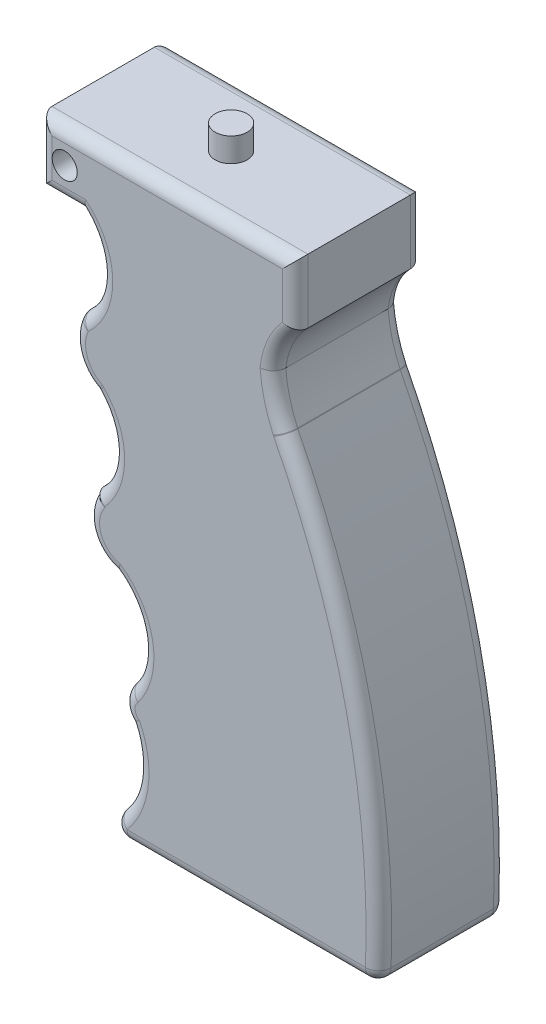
ISO-10303-21;
HEADER;
FILE_DESCRIPTION(('STEP AP214'),'2;1');
FILE_NAME('part.step','',(''),(''),'','','');
FILE_SCHEMA(('AUTOMOTIVE_DESIGN { 1 0 10303 214 1 1 1 1 }'));
ENDSEC;
DATA;
#1=APPLICATION_CONTEXT('core data for automotive mechanical design processes');
#2=APPLICATION_PROTOCOL_DEFINITION('international standard','automotive_design',2000,#1);
#3=PRODUCT_CONTEXT('',#1,'mechanical');
#4=PRODUCT('Part','Part','',(#3));
#5=PRODUCT_RELATED_PRODUCT_CATEGORY('part','',(#4));
#6=PRODUCT_DEFINITION_FORMATION('','',#4);
#7=PRODUCT_DEFINITION_CONTEXT('part definition',#1,'design');
#8=PRODUCT_DEFINITION('design','',#6,#7);
#9=PRODUCT_DEFINITION_SHAPE('','',#8);
#10=(LENGTH_UNIT() NAMED_UNIT(*) SI_UNIT(.MILLI.,.METRE.));
#11=(NAMED_UNIT(*) PLANE_ANGLE_UNIT() SI_UNIT($,.RADIAN.));
#12=(NAMED_UNIT(*) SI_UNIT($,.STERADIAN.) SOLID_ANGLE_UNIT());
#13=UNCERTAINTY_MEASURE_WITH_UNIT(LENGTH_MEASURE(1.E-05),#10,'distance_accuracy_value','');
#14=(GEOMETRIC_REPRESENTATION_CONTEXT(3) GLOBAL_UNCERTAINTY_ASSIGNED_CONTEXT((#13)) GLOBAL_UNIT_ASSIGNED_CONTEXT((#10,
#11,#12)) REPRESENTATION_CONTEXT('',''));
#15=CARTESIAN_POINT('',(0.,0.,0.));
#16=DIRECTION('',(0.,0.,1.));
#17=DIRECTION('',(1.,0.,0.));
#18=AXIS2_PLACEMENT_3D('',#15,#16,#17);
#19=CARTESIAN_POINT('',(-38.1,58.42,25.4));
#20=DIRECTION('',(1.,0.,0.));
#21=DIRECTION('',(0.,0.,-1.));
#22=AXIS2_PLACEMENT_3D('',#19,#20,#21);
#23=PLANE('',#22);
#24=DIRECTION('',(0.,0.,-1.));
#25=VECTOR('',#24,1.);
#26=CARTESIAN_POINT('',(-38.1,45.72,25.4));
#27=LINE('',#26,#25);
#28=CARTESIAN_POINT('',(-38.1,45.72,22.86));
#29=VERTEX_POINT('',#28);
#30=CARTESIAN_POINT('',(-38.1,45.72,2.54));
#31=VERTEX_POINT('',#30);
#32=EDGE_CURVE('E856',#29,#31,#27,.T.);
#33=ORIENTED_EDGE('',*,*,#32,.F.);
#34=DIRECTION('',(0.,-1.,0.));
#35=VECTOR('',#34,1.);
#36=CARTESIAN_POINT('',(-38.1,58.42,22.86));
#37=LINE('',#36,#35);
#38=CARTESIAN_POINT('',(-38.1,58.42,22.86));
#39=VERTEX_POINT('',#38);
#40=EDGE_CURVE('E792',#29,#39,#37,.F.);
#41=ORIENTED_EDGE('',*,*,#40,.T.);
#42=DIRECTION('',(0.,0.,-1.));
#43=VECTOR('',#42,1.);
#44=CARTESIAN_POINT('',(-38.1,58.42,25.4));
#45=LINE('',#44,#43);
#46=CARTESIAN_POINT('',(-38.1,58.42,2.54));
#47=VERTEX_POINT('',#46);
#48=EDGE_CURVE('E915',#39,#47,#45,.T.);
#49=ORIENTED_EDGE('',*,*,#48,.T.);
#50=DIRECTION('',(0.,-1.,0.));
#51=VECTOR('',#50,1.);
#52=CARTESIAN_POINT('',(-38.1,45.72,2.54));
#53=LINE('',#52,#51);
#54=EDGE_CURVE('E641',#47,#31,#53,.T.);
#55=ORIENTED_EDGE('',*,*,#54,.T.);
#56=EDGE_LOOP('',(#33,#41,#49,#55));
#57=FACE_BOUND('',#56,.T.);
#58=ADVANCED_FACE('F35',(#57),#23,.F.);
#59=CARTESIAN_POINT('',(-38.1,45.72,25.4));
#60=DIRECTION('',(0.,1.,0.));
#61=DIRECTION('',(0.,0.,1.));
#62=AXIS2_PLACEMENT_3D('',#59,#60,#61);
#63=PLANE('',#62);
#64=DIRECTION('',(0.,0.,-1.));
#65=VECTOR('',#64,1.);
#66=CARTESIAN_POINT('',(-29.8173913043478,45.72,25.4));
#67=LINE('',#66,#65);
#68=CARTESIAN_POINT('',(-29.8173913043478,45.72,22.86));
#69=VERTEX_POINT('',#68);
#70=CARTESIAN_POINT('',(-29.8173913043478,45.72,2.54));
#71=VERTEX_POINT('',#70);
#72=EDGE_CURVE('E298',#69,#71,#67,.T.);
#73=ORIENTED_EDGE('',*,*,#72,.F.);
#74=DIRECTION('',(1.,0.,0.));
#75=VECTOR('',#74,1.);
#76=CARTESIAN_POINT('',(-38.1,45.72,22.86));
#77=LINE('',#76,#75);
#78=EDGE_CURVE('E794',#69,#29,#77,.F.);
#79=ORIENTED_EDGE('',*,*,#78,.T.);
#80=ORIENTED_EDGE('',*,*,#32,.T.);
#81=DIRECTION('',(1.,0.,0.));
#82=VECTOR('',#81,1.);
#83=CARTESIAN_POINT('',(-29.8173913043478,45.72,2.54));
#84=LINE('',#83,#82);
#85=EDGE_CURVE('E309',#31,#71,#84,.T.);
#86=ORIENTED_EDGE('',*,*,#85,.T.);
#87=EDGE_LOOP('',(#73,#79,#80,#86));
#88=FACE_BOUND('',#87,.T.);
#89=ADVANCED_FACE('F914',(#88),#63,.F.);
#90=CARTESIAN_POINT('',(-38.3044329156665,36.8474684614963,25.4));
#91=DIRECTION('',(0.,0.,-1.));
#92=DIRECTION('',(-1.,0.,0.));
#93=AXIS2_PLACEMENT_3D('',#90,#91,#92);
#94=CYLINDRICAL_SURFACE('',#93,12.2780980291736);
#95=CARTESIAN_POINT('',(-38.3044329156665,36.8474684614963,2.54));
#96=DIRECTION('',(0.,0.,-1.));
#97=DIRECTION('',(-1.,0.,0.));
#98=AXIS2_PLACEMENT_3D('',#95,#96,#97);
#99=CIRCLE('',#98,12.2780980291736);
#100=CARTESIAN_POINT('',(-30.0472871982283,27.7605968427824,2.54));
#101=VERTEX_POINT('',#100);
#102=EDGE_CURVE('E322',#71,#101,#99,.T.);
#103=ORIENTED_EDGE('',*,*,#102,.T.);
#104=DIRECTION('',(0.,0.,-1.));
#105=VECTOR('',#104,1.);
#106=CARTESIAN_POINT('',(-30.0472871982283,27.7605968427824,25.4));
#107=LINE('',#106,#105);
#108=CARTESIAN_POINT('',(-30.0472871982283,27.7605968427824,22.86));
#109=VERTEX_POINT('',#108);
#110=EDGE_CURVE('E737',#101,#109,#107,.F.);
#111=ORIENTED_EDGE('',*,*,#110,.T.);
#112=CARTESIAN_POINT('',(-38.3044329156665,36.8474684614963,22.86));
#113=DIRECTION('',(0.,0.,-1.));
#114=DIRECTION('',(-1.,0.,0.));
#115=AXIS2_PLACEMENT_3D('',#112,#113,#114);
#116=CIRCLE('',#115,12.2780980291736);
#117=EDGE_CURVE('E662',#109,#69,#116,.F.);
#118=ORIENTED_EDGE('',*,*,#117,.T.);
#119=ORIENTED_EDGE('',*,*,#72,.T.);
#120=EDGE_LOOP('',(#103,#111,#118,#119));
#121=FACE_BOUND('',#120,.T.);
#122=ADVANCED_FACE('F905',(#121),#94,.F.);
#123=CARTESIAN_POINT('',(-23.0348276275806,23.4007930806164,25.4));
#124=DIRECTION('',(0.,0.,-1.));
#125=DIRECTION('',(-1.,0.,0.));
#126=AXIS2_PLACEMENT_3D('',#123,#124,#125);
#127=CYLINDRICAL_SURFACE('',#126,8.39540174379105);
#128=CARTESIAN_POINT('',(-23.0348276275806,23.4007930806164,22.86));
#129=DIRECTION('',(0.,0.,-1.));
#130=DIRECTION('',(-1.,0.,0.));
#131=AXIS2_PLACEMENT_3D('',#128,#129,#130);
#132=CIRCLE('',#131,8.39540174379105);
#133=CARTESIAN_POINT('',(-27.1051629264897,16.0581000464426,22.86));
#134=VERTEX_POINT('',#133);
#135=CARTESIAN_POINT('',(-30.6400432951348,26.9565581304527,22.86));
#136=VERTEX_POINT('',#135);
#137=EDGE_CURVE('E734',#134,#136,#132,.T.);
#138=ORIENTED_EDGE('',*,*,#137,.T.);
#139=DIRECTION('',(0.,0.,-1.));
#140=VECTOR('',#139,1.);
#141=CARTESIAN_POINT('',(-30.6400432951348,26.9565581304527,25.4));
#142=LINE('',#141,#140);
#143=CARTESIAN_POINT('',(-30.6400432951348,26.9565581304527,2.54));
#144=VERTEX_POINT('',#143);
#145=EDGE_CURVE('E305',#136,#144,#142,.T.);
#146=ORIENTED_EDGE('',*,*,#145,.T.);
#147=CARTESIAN_POINT('',(-23.0348276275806,23.4007930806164,2.54));
#148=DIRECTION('',(0.,0.,-1.));
#149=DIRECTION('',(-1.,0.,0.));
#150=AXIS2_PLACEMENT_3D('',#147,#148,#149);
#151=CIRCLE('',#150,8.39540174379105);
#152=CARTESIAN_POINT('',(-27.1051629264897,16.0581000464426,2.54));
#153=VERTEX_POINT('',#152);
#154=EDGE_CURVE('E302',#144,#153,#151,.F.);
#155=ORIENTED_EDGE('',*,*,#154,.T.);
#156=DIRECTION('',(0.,0.,-1.));
#157=VECTOR('',#156,1.);
#158=CARTESIAN_POINT('',(-27.1051629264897,16.0581000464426,25.4));
#159=LINE('',#158,#157);
#160=EDGE_CURVE('E287',#134,#153,#159,.T.);
#161=ORIENTED_EDGE('',*,*,#160,.F.);
#162=EDGE_LOOP('',(#138,#146,#155,#161));
#163=FACE_BOUND('',#162,.T.);
#164=ADVANCED_FACE('F303',(#163),#127,.T.);
#165=CARTESIAN_POINT('',(-27.0979406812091,16.050564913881,25.4));
#166=DIRECTION('',(0.721936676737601,0.691959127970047,0.));
#167=DIRECTION('',(-0.691959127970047,0.721936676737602,0.));
#168=AXIS2_PLACEMENT_3D('',#165,#166,#167);
#169=PLANE('',#168);
#170=DIRECTION('',(0.,0.,-1.));
#171=VECTOR('',#170,1.);
#172=CARTESIAN_POINT('',(-27.0979406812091,16.050564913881,25.4));
#173=LINE('',#172,#171);
#174=CARTESIAN_POINT('',(-27.0979406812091,16.050564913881,22.86));
#175=VERTEX_POINT('',#174);
#176=CARTESIAN_POINT('',(-27.0979406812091,16.050564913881,2.54));
#177=VERTEX_POINT('',#176);
#178=EDGE_CURVE('E299',#175,#177,#173,.T.);
#179=ORIENTED_EDGE('',*,*,#178,.F.);
#180=DIRECTION('',(0.691959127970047,-0.721936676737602,0.));
#181=VECTOR('',#180,1.);
#182=CARTESIAN_POINT('',(-27.0979406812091,16.050564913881,22.86));
#183=LINE('',#182,#181);
#184=EDGE_CURVE('E295',#175,#134,#183,.F.);
#185=ORIENTED_EDGE('',*,*,#184,.T.);
#186=ORIENTED_EDGE('',*,*,#160,.T.);
#187=DIRECTION('',(0.691959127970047,-0.721936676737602,0.));
#188=VECTOR('',#187,1.);
#189=CARTESIAN_POINT('',(-27.0979406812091,16.050564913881,2.54));
#190=LINE('',#189,#188);
#191=EDGE_CURVE('E292',#153,#177,#190,.T.);
#192=ORIENTED_EDGE('',*,*,#191,.T.);
#193=EDGE_LOOP('',(#179,#185,#186,#192));
#194=FACE_BOUND('',#193,.T.);
#195=ADVANCED_FACE('F290',(#194),#169,.F.);
#196=CARTESIAN_POINT('',(-36.0222495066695,7.50405597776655,25.4));
#197=DIRECTION('',(0.,0.,-1.));
#198=DIRECTION('',(-1.,0.,0.));
#199=AXIS2_PLACEMENT_3D('',#196,#197,#198);
#200=CYLINDRICAL_SURFACE('',#199,12.356621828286);
#201=DIRECTION('',(0.,0.,-1.));
#202=VECTOR('',#201,1.);
#203=CARTESIAN_POINT('',(-27.5390403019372,-1.48044537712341,25.4));
#204=LINE('',#203,#202);
#205=CARTESIAN_POINT('',(-27.5390403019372,-1.48044537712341,22.86));
#206=VERTEX_POINT('',#205);
#207=CARTESIAN_POINT('',(-27.5390403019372,-1.48044537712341,2.54));
#208=VERTEX_POINT('',#207);
#209=EDGE_CURVE('E851',#206,#208,#204,.T.);
#210=ORIENTED_EDGE('',*,*,#209,.F.);
#211=CARTESIAN_POINT('',(-36.0222495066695,7.50405597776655,22.86));
#212=DIRECTION('',(0.,0.,-1.));
#213=DIRECTION('',(-1.,0.,0.));
#214=AXIS2_PLACEMENT_3D('',#211,#212,#213);
#215=CIRCLE('',#214,12.356621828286);
#216=EDGE_CURVE('E797',#206,#175,#215,.F.);
#217=ORIENTED_EDGE('',*,*,#216,.T.);
#218=ORIENTED_EDGE('',*,*,#178,.T.);
#219=CARTESIAN_POINT('',(-36.0222495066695,7.50405597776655,2.54));
#220=DIRECTION('',(0.,0.,-1.));
#221=DIRECTION('',(-1.,0.,0.));
#222=AXIS2_PLACEMENT_3D('',#219,#220,#221);
#223=CIRCLE('',#222,12.356621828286);
#224=EDGE_CURVE('E321',#177,#208,#223,.T.);
#225=ORIENTED_EDGE('',*,*,#224,.T.);
#226=EDGE_LOOP('',(#210,#217,#218,#225));
#227=FACE_BOUND('',#226,.T.);
#228=ADVANCED_FACE('F996',(#227),#200,.F.);
#229=CARTESIAN_POINT('',(-27.5390403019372,-1.93612750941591,25.4));
#230=DIRECTION('',(1.,0.,0.));
#231=DIRECTION('',(0.,0.,-1.));
#232=AXIS2_PLACEMENT_3D('',#229,#230,#231);
#233=PLANE('',#232);
#234=DIRECTION('',(0.,0.,-1.));
#235=VECTOR('',#234,1.);
#236=CARTESIAN_POINT('',(-27.5390403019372,-1.93612750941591,25.4));
#237=LINE('',#236,#235);
#238=CARTESIAN_POINT('',(-27.5390403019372,-1.93612750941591,22.86));
#239=VERTEX_POINT('',#238);
#240=CARTESIAN_POINT('',(-27.5390403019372,-1.93612750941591,2.54));
#241=VERTEX_POINT('',#240);
#242=EDGE_CURVE('E849',#239,#241,#237,.T.);
#243=ORIENTED_EDGE('',*,*,#242,.F.);
#244=DIRECTION('',(0.,-1.,0.));
#245=VECTOR('',#244,1.);
#246=CARTESIAN_POINT('',(-27.5390403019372,-1.93612750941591,22.86));
#247=LINE('',#246,#245);
#248=EDGE_CURVE('E799',#239,#206,#247,.F.);
#249=ORIENTED_EDGE('',*,*,#248,.T.);
#250=ORIENTED_EDGE('',*,*,#209,.T.);
#251=DIRECTION('',(0.,-1.,0.));
#252=VECTOR('',#251,1.);
#253=CARTESIAN_POINT('',(-27.5390403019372,-1.93612750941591,2.54));
#254=LINE('',#253,#252);
#255=EDGE_CURVE('E673',#208,#241,#254,.T.);
#256=ORIENTED_EDGE('',*,*,#255,.T.);
#257=EDGE_LOOP('',(#243,#249,#250,#256));
#258=FACE_BOUND('',#257,.T.);
#259=ADVANCED_FACE('F999',(#258),#233,.F.);
#260=CARTESIAN_POINT('',(-21.0202297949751,-5.90005965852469,25.4));
#261=DIRECTION('',(0.,0.,-1.));
#262=DIRECTION('',(-1.,0.,0.));
#263=AXIS2_PLACEMENT_3D('',#260,#261,#262);
#264=CYLINDRICAL_SURFACE('',#263,7.62939371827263);
#265=DIRECTION('',(0.,0.,-1.));
#266=VECTOR('',#265,1.);
#267=CARTESIAN_POINT('',(-23.0581660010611,-13.2522337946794,25.4));
#268=LINE('',#267,#266);
#269=CARTESIAN_POINT('',(-23.0581660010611,-13.2522337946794,22.86));
#270=VERTEX_POINT('',#269);
#271=CARTESIAN_POINT('',(-23.0581660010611,-13.2522337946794,2.54));
#272=VERTEX_POINT('',#271);
#273=EDGE_CURVE('E847',#270,#272,#268,.T.);
#274=ORIENTED_EDGE('',*,*,#273,.F.);
#275=CARTESIAN_POINT('',(-21.0202297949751,-5.90005965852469,22.86));
#276=DIRECTION('',(0.,0.,-1.));
#277=DIRECTION('',(-1.,0.,0.));
#278=AXIS2_PLACEMENT_3D('',#275,#276,#277);
#279=CIRCLE('',#278,7.62939371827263);
#280=EDGE_CURVE('E801',#270,#239,#279,.T.);
#281=ORIENTED_EDGE('',*,*,#280,.T.);
#282=ORIENTED_EDGE('',*,*,#242,.T.);
#283=CARTESIAN_POINT('',(-21.0202297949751,-5.90005965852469,2.54));
#284=DIRECTION('',(0.,0.,-1.));
#285=DIRECTION('',(-1.,0.,0.));
#286=AXIS2_PLACEMENT_3D('',#283,#284,#285);
#287=CIRCLE('',#286,7.62939371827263);
#288=EDGE_CURVE('E676',#241,#272,#287,.F.);
#289=ORIENTED_EDGE('',*,*,#288,.T.);
#290=EDGE_LOOP('',(#274,#281,#282,#289));
#291=FACE_BOUND('',#290,.T.);
#292=ADVANCED_FACE('F1003',(#291),#264,.T.);
#293=CARTESIAN_POINT('',(-30.7421767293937,-23.5950337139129,25.4));
#294=DIRECTION('',(0.,0.,-1.));
#295=DIRECTION('',(-1.,0.,0.));
#296=AXIS2_PLACEMENT_3D('',#293,#294,#295);
#297=CYLINDRICAL_SURFACE('',#296,12.8847790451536);
#298=DIRECTION('',(0.,0.,-1.));
#299=VECTOR('',#298,1.);
#300=CARTESIAN_POINT('',(-20.3993768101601,-31.2790444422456,25.4));
#301=LINE('',#300,#299);
#302=CARTESIAN_POINT('',(-20.3993768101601,-31.2790444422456,22.86));
#303=VERTEX_POINT('',#302);
#304=CARTESIAN_POINT('',(-20.3993768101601,-31.2790444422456,2.54));
#305=VERTEX_POINT('',#304);
#306=EDGE_CURVE('E842',#303,#305,#301,.T.);
#307=ORIENTED_EDGE('',*,*,#306,.F.);
#308=CARTESIAN_POINT('',(-30.7421767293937,-23.5950337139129,22.86));
#309=DIRECTION('',(0.,0.,-1.));
#310=DIRECTION('',(-1.,0.,0.));
#311=AXIS2_PLACEMENT_3D('',#308,#309,#310);
#312=CIRCLE('',#311,12.8847790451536);
#313=EDGE_CURVE('E803',#303,#270,#312,.F.);
#314=ORIENTED_EDGE('',*,*,#313,.T.);
#315=ORIENTED_EDGE('',*,*,#273,.T.);
#316=CARTESIAN_POINT('',(-30.7421767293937,-23.5950337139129,2.54));
#317=DIRECTION('',(0.,0.,-1.));
#318=DIRECTION('',(-1.,0.,0.));
#319=AXIS2_PLACEMENT_3D('',#316,#317,#318);
#320=CIRCLE('',#319,12.8847790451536);
#321=EDGE_CURVE('E679',#272,#305,#320,.T.);
#322=ORIENTED_EDGE('',*,*,#321,.T.);
#323=EDGE_LOOP('',(#307,#314,#315,#322));
#324=FACE_BOUND('',#323,.T.);
#325=ADVANCED_FACE('F1007',(#324),#297,.F.);
#326=CARTESIAN_POINT('',(-17.231521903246,-34.2956082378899,25.4));
#327=DIRECTION('',(0.,0.,-1.));
#328=DIRECTION('',(-1.,0.,0.));
#329=AXIS2_PLACEMENT_3D('',#326,#327,#328);
#330=CYLINDRICAL_SURFACE('',#329,4.37435273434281);
#331=DIRECTION('',(0.,0.,-1.));
#332=VECTOR('',#331,1.);
#333=CARTESIAN_POINT('',(-20.2480856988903,-37.4634631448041,25.4));
#334=LINE('',#333,#332);
#335=CARTESIAN_POINT('',(-20.2480856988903,-37.4634631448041,22.86));
#336=VERTEX_POINT('',#335);
#337=CARTESIAN_POINT('',(-20.2480856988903,-37.4634631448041,2.54));
#338=VERTEX_POINT('',#337);
#339=EDGE_CURVE('E840',#336,#338,#334,.T.);
#340=ORIENTED_EDGE('',*,*,#339,.F.);
#341=CARTESIAN_POINT('',(-17.231521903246,-34.2956082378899,22.86));
#342=DIRECTION('',(0.,0.,-1.));
#343=DIRECTION('',(-1.,0.,0.));
#344=AXIS2_PLACEMENT_3D('',#341,#342,#343);
#345=CIRCLE('',#344,4.37435273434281);
#346=EDGE_CURVE('E805',#336,#303,#345,.T.);
#347=ORIENTED_EDGE('',*,*,#346,.T.);
#348=ORIENTED_EDGE('',*,*,#306,.T.);
#349=CARTESIAN_POINT('',(-17.231521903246,-34.2956082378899,2.54));
#350=DIRECTION('',(0.,0.,-1.));
#351=DIRECTION('',(-1.,0.,0.));
#352=AXIS2_PLACEMENT_3D('',#349,#350,#351);
#353=CIRCLE('',#352,4.37435273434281);
#354=EDGE_CURVE('E682',#305,#338,#353,.F.);
#355=ORIENTED_EDGE('',*,*,#354,.T.);
#356=EDGE_LOOP('',(#340,#347,#348,#355));
#357=FACE_BOUND('',#356,.T.);
#358=ADVANCED_FACE('F1011',(#357),#330,.T.);
#359=CARTESIAN_POINT('',(-34.65918680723,-44.0088988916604,25.4));
#360=DIRECTION('',(0.,0.,-1.));
#361=DIRECTION('',(-1.,0.,0.));
#362=AXIS2_PLACEMENT_3D('',#359,#360,#361);
#363=CYLINDRICAL_SURFACE('',#362,15.8279046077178);
#364=CARTESIAN_POINT('',(-34.65918680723,-44.0088988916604,2.54));
#365=DIRECTION('',(0.,0.,-1.));
#366=DIRECTION('',(-1.,0.,0.));
#367=AXIS2_PLACEMENT_3D('',#364,#365,#366);
#368=CIRCLE('',#367,15.8279046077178);
#369=CARTESIAN_POINT('',(-22.5811199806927,-54.2384084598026,2.54));
#370=VERTEX_POINT('',#369);
#371=EDGE_CURVE('E685',#338,#370,#368,.T.);
#372=ORIENTED_EDGE('',*,*,#371,.T.);
#373=DIRECTION('',(0.,0.,-1.));
#374=VECTOR('',#373,1.);
#375=CARTESIAN_POINT('',(-22.5811199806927,-54.2384084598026,25.4));
#376=LINE('',#375,#374);
#377=CARTESIAN_POINT('',(-22.5811199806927,-54.2384084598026,22.86));
#378=VERTEX_POINT('',#377);
#379=EDGE_CURVE('E788',#370,#378,#376,.F.);
#380=ORIENTED_EDGE('',*,*,#379,.T.);
#381=CARTESIAN_POINT('',(-34.65918680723,-44.0088988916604,22.86));
#382=DIRECTION('',(0.,0.,-1.));
#383=DIRECTION('',(-1.,0.,0.));
#384=AXIS2_PLACEMENT_3D('',#381,#382,#383);
#385=CIRCLE('',#384,15.8279046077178);
#386=EDGE_CURVE('E786',#378,#336,#385,.F.);
#387=ORIENTED_EDGE('',*,*,#386,.T.);
#388=ORIENTED_EDGE('',*,*,#339,.T.);
#389=EDGE_LOOP('',(#372,#380,#387,#388));
#390=FACE_BOUND('',#389,.T.);
#391=ADVANCED_FACE('F1015',(#390),#363,.F.);
#392=CARTESIAN_POINT('',(29.0847814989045,-58.42,25.4));
#393=DIRECTION('',(0.,1.,0.));
#394=DIRECTION('',(-1.,0.,0.));
#395=AXIS2_PLACEMENT_3D('',#392,#393,#394);
#396=PLANE('',#395);
#397=DIRECTION('',(1.,0.,0.));
#398=VECTOR('',#397,1.);
#399=CARTESIAN_POINT('',(29.0847814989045,-58.42,2.54));
#400=LINE('',#399,#398);
#401=CARTESIAN_POINT('',(-20.6428792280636,-58.42,2.54));
#402=VERTEX_POINT('',#401);
#403=CARTESIAN_POINT('',(26.6563040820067,-58.42,2.54));
#404=VERTEX_POINT('',#403);
#405=EDGE_CURVE('E688',#402,#404,#400,.T.);
#406=ORIENTED_EDGE('',*,*,#405,.T.);
#407=DIRECTION('',(0.,0.,-1.));
#408=VECTOR('',#407,1.);
#409=CARTESIAN_POINT('',(26.6563040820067,-58.42,25.4));
#410=LINE('',#409,#408);
#411=CARTESIAN_POINT('',(26.6563040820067,-58.42,22.86));
#412=VERTEX_POINT('',#411);
#413=EDGE_CURVE('E780',#404,#412,#410,.F.);
#414=ORIENTED_EDGE('',*,*,#413,.T.);
#415=DIRECTION('',(1.,0.,0.));
#416=VECTOR('',#415,1.);
#417=CARTESIAN_POINT('',(29.0847814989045,-58.42,22.86));
#418=LINE('',#417,#416);
#419=CARTESIAN_POINT('',(-20.6428792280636,-58.42,22.86));
#420=VERTEX_POINT('',#419);
#421=EDGE_CURVE('E778',#412,#420,#418,.F.);
#422=ORIENTED_EDGE('',*,*,#421,.T.);
#423=DIRECTION('',(0.,0.,-1.));
#424=VECTOR('',#423,1.);
#425=CARTESIAN_POINT('',(-20.6428792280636,-58.42,25.4));
#426=LINE('',#425,#424);
#427=EDGE_CURVE('E776',#420,#402,#426,.T.);
#428=ORIENTED_EDGE('',*,*,#427,.T.);
#429=EDGE_LOOP('',(#406,#414,#422,#428));
#430=FACE_BOUND('',#429,.T.);
#431=ADVANCED_FACE('F1019',(#430),#396,.F.);
#432=CARTESIAN_POINT('',(-139.346748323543,-49.6348770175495,25.4));
#433=DIRECTION('',(0.,0.,-1.));
#434=DIRECTION('',(-1.,0.,0.));
#435=AXIS2_PLACEMENT_3D('',#432,#433,#434);
#436=CYLINDRICAL_SURFACE('',#435,168.660483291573);
#437=CARTESIAN_POINT('',(-139.346748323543,-49.6348770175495,22.86));
#438=DIRECTION('',(0.,0.,-1.));
#439=DIRECTION('',(-1.,0.,0.));
#440=AXIS2_PLACEMENT_3D('',#437,#438,#439);
#441=CIRCLE('',#440,168.660483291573);
#442=CARTESIAN_POINT('',(10.6927517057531,27.4008747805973,22.86));
#443=VERTEX_POINT('',#442);
#444=CARTESIAN_POINT('',(29.1945085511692,-55.9754885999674,22.86));
#445=VERTEX_POINT('',#444);
#446=EDGE_CURVE('E782',#443,#445,#441,.T.);
#447=ORIENTED_EDGE('',*,*,#446,.T.);
#448=DIRECTION('',(0.,0.,-1.));
#449=VECTOR('',#448,1.);
#450=CARTESIAN_POINT('',(29.1945085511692,-55.9754885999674,25.4));
#451=LINE('',#450,#449);
#452=CARTESIAN_POINT('',(29.1945085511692,-55.9754885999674,2.54));
#453=VERTEX_POINT('',#452);
#454=EDGE_CURVE('E784',#445,#453,#451,.T.);
#455=ORIENTED_EDGE('',*,*,#454,.T.);
#456=CARTESIAN_POINT('',(-139.346748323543,-49.6348770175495,2.54));
#457=DIRECTION('',(0.,0.,-1.));
#458=DIRECTION('',(-1.,0.,0.));
#459=AXIS2_PLACEMENT_3D('',#456,#457,#458);
#460=CIRCLE('',#459,168.660483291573);
#461=CARTESIAN_POINT('',(10.6927517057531,27.4008747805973,2.54));
#462=VERTEX_POINT('',#461);
#463=EDGE_CURVE('E691',#453,#462,#460,.F.);
#464=ORIENTED_EDGE('',*,*,#463,.T.);
#465=DIRECTION('',(0.,0.,-1.));
#466=VECTOR('',#465,1.);
#467=CARTESIAN_POINT('',(10.6927517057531,27.4008747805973,25.4));
#468=LINE('',#467,#466);
#469=EDGE_CURVE('E824',#443,#462,#468,.T.);
#470=ORIENTED_EDGE('',*,*,#469,.F.);
#471=EDGE_LOOP('',(#447,#455,#464,#470));
#472=FACE_BOUND('',#471,.T.);
#473=ADVANCED_FACE('F837',(#472),#436,.T.);
#474=CARTESIAN_POINT('',(10.6467289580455,27.5019147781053,25.4));
#475=DIRECTION('',(-0.910042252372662,-0.414515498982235,0.));
#476=DIRECTION('',(0.414515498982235,-0.910042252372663,0.));
#477=AXIS2_PLACEMENT_3D('',#474,#475,#476);
#478=PLANE('',#477);
#479=DIRECTION('',(0.,0.,-1.));
#480=VECTOR('',#479,1.);
#481=CARTESIAN_POINT('',(10.6467289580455,27.5019147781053,25.4));
#482=LINE('',#481,#480);
#483=CARTESIAN_POINT('',(10.6467289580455,27.5019147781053,22.86));
#484=VERTEX_POINT('',#483);
#485=CARTESIAN_POINT('',(10.6467289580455,27.5019147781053,2.54));
#486=VERTEX_POINT('',#485);
#487=EDGE_CURVE('E814',#484,#486,#482,.T.);
#488=ORIENTED_EDGE('',*,*,#487,.F.);
#489=DIRECTION('',(-0.414515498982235,0.910042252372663,0.));
#490=VECTOR('',#489,1.);
#491=CARTESIAN_POINT('',(10.6467289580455,27.5019147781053,22.86));
#492=LINE('',#491,#490);
#493=EDGE_CURVE('E807',#484,#443,#492,.F.);
#494=ORIENTED_EDGE('',*,*,#493,.T.);
#495=ORIENTED_EDGE('',*,*,#469,.T.);
#496=DIRECTION('',(-0.414515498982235,0.910042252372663,0.));
#497=VECTOR('',#496,1.);
#498=CARTESIAN_POINT('',(10.6467289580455,27.5019147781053,2.54));
#499=LINE('',#498,#497);
#500=EDGE_CURVE('E694',#462,#486,#499,.T.);
#501=ORIENTED_EDGE('',*,*,#500,.T.);
#502=EDGE_LOOP('',(#488,#494,#495,#501));
#503=FACE_BOUND('',#502,.T.);
#504=ADVANCED_FACE('F819',(#503),#478,.F.);
#505=CARTESIAN_POINT('',(35.5554141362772,38.7865800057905,25.4));
#506=DIRECTION('',(0.,0.,-1.));
#507=DIRECTION('',(-1.,0.,0.));
#508=AXIS2_PLACEMENT_3D('',#505,#506,#507);
#509=CYLINDRICAL_SURFACE('',#508,27.345680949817);
#510=DIRECTION('',(0.,0.,-1.));
#511=VECTOR('',#510,1.);
#512=CARTESIAN_POINT('',(8.2926430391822,36.658769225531,25.4));
#513=LINE('',#512,#511);
#514=CARTESIAN_POINT('',(8.2926430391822,36.658769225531,22.86));
#515=VERTEX_POINT('',#514);
#516=CARTESIAN_POINT('',(8.2926430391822,36.658769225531,2.54));
#517=VERTEX_POINT('',#516);
#518=EDGE_CURVE('E815',#515,#517,#513,.T.);
#519=ORIENTED_EDGE('',*,*,#518,.F.);
#520=CARTESIAN_POINT('',(35.5554141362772,38.7865800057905,22.86));
#521=DIRECTION('',(0.,0.,-1.));
#522=DIRECTION('',(-1.,0.,0.));
#523=AXIS2_PLACEMENT_3D('',#520,#521,#522);
#524=CIRCLE('',#523,27.345680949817);
#525=EDGE_CURVE('E809',#515,#484,#524,.F.);
#526=ORIENTED_EDGE('',*,*,#525,.T.);
#527=ORIENTED_EDGE('',*,*,#487,.T.);
#528=CARTESIAN_POINT('',(35.5554141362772,38.7865800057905,2.54));
#529=DIRECTION('',(0.,0.,-1.));
#530=DIRECTION('',(-1.,0.,0.));
#531=AXIS2_PLACEMENT_3D('',#528,#529,#530);
#532=CIRCLE('',#531,27.345680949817);
#533=EDGE_CURVE('E697',#486,#517,#532,.T.);
#534=ORIENTED_EDGE('',*,*,#533,.T.);
#535=EDGE_LOOP('',(#519,#526,#527,#534));
#536=FACE_BOUND('',#535,.T.);
#537=ADVANCED_FACE('F813',(#536),#509,.F.);
#538=CARTESIAN_POINT('',(23.3609712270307,34.9320554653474,25.4));
#539=DIRECTION('',(0.,0.,-1.));
#540=DIRECTION('',(-1.,0.,0.));
#541=AXIS2_PLACEMENT_3D('',#538,#539,#540);
#542=CYLINDRICAL_SURFACE('',#541,15.1669395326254);
#543=DIRECTION('',(0.,0.,-1.));
#544=VECTOR('',#543,1.);
#545=CARTESIAN_POINT('',(12.7,45.72,25.4));
#546=LINE('',#545,#544);
#547=CARTESIAN_POINT('',(12.7,45.72,22.86));
#548=VERTEX_POINT('',#547);
#549=CARTESIAN_POINT('',(12.7,45.72,2.54));
#550=VERTEX_POINT('',#549);
#551=EDGE_CURVE('E959',#548,#550,#546,.T.);
#552=ORIENTED_EDGE('',*,*,#551,.F.);
#553=CARTESIAN_POINT('',(23.3609712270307,34.9320554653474,22.86));
#554=DIRECTION('',(0.,0.,-1.));
#555=DIRECTION('',(-1.,0.,0.));
#556=AXIS2_PLACEMENT_3D('',#553,#554,#555);
#557=CIRCLE('',#556,15.1669395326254);
#558=EDGE_CURVE('E58',#548,#515,#557,.F.);
#559=ORIENTED_EDGE('',*,*,#558,.T.);
#560=ORIENTED_EDGE('',*,*,#518,.T.);
#561=CARTESIAN_POINT('',(23.3609712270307,34.9320554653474,2.54));
#562=DIRECTION('',(0.,0.,-1.));
#563=DIRECTION('',(-1.,0.,0.));
#564=AXIS2_PLACEMENT_3D('',#561,#562,#563);
#565=CIRCLE('',#564,15.1669395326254);
#566=EDGE_CURVE('E700',#517,#550,#565,.T.);
#567=ORIENTED_EDGE('',*,*,#566,.T.);
#568=EDGE_LOOP('',(#552,#559,#560,#567));
#569=FACE_BOUND('',#568,.T.);
#570=ADVANCED_FACE('F960',(#569),#542,.F.);
#571=CARTESIAN_POINT('',(12.7,58.42,25.4));
#572=DIRECTION('',(-1.,0.,0.));
#573=DIRECTION('',(0.,-1.,0.));
#574=AXIS2_PLACEMENT_3D('',#571,#572,#573);
#575=PLANE('',#574);
#576=DIRECTION('',(0.,0.,-1.));
#577=VECTOR('',#576,1.);
#578=CARTESIAN_POINT('',(12.7,58.42,25.4));
#579=LINE('',#578,#577);
#580=CARTESIAN_POINT('',(12.7,58.42,22.86));
#581=VERTEX_POINT('',#580);
#582=CARTESIAN_POINT('',(12.7,58.42,2.54));
#583=VERTEX_POINT('',#582);
#584=EDGE_CURVE('E920',#581,#583,#579,.T.);
#585=ORIENTED_EDGE('',*,*,#584,.F.);
#586=DIRECTION('',(0.,1.,0.));
#587=VECTOR('',#586,1.);
#588=CARTESIAN_POINT('',(12.7,58.42,22.86));
#589=LINE('',#588,#587);
#590=EDGE_CURVE('E44',#581,#548,#589,.F.);
#591=ORIENTED_EDGE('',*,*,#590,.T.);
#592=ORIENTED_EDGE('',*,*,#551,.T.);
#593=DIRECTION('',(0.,1.,0.));
#594=VECTOR('',#593,1.);
#595=CARTESIAN_POINT('',(12.7,58.42,2.54));
#596=LINE('',#595,#594);
#597=EDGE_CURVE('E703',#550,#583,#596,.T.);
#598=ORIENTED_EDGE('',*,*,#597,.T.);
#599=EDGE_LOOP('',(#585,#591,#592,#598));
#600=FACE_BOUND('',#599,.T.);
#601=ADVANCED_FACE('F973',(#600),#575,.F.);
#602=CARTESIAN_POINT('',(-38.1,58.42,25.4));
#603=DIRECTION('',(0.,-1.,0.));
#604=DIRECTION('',(1.,0.,0.));
#605=AXIS2_PLACEMENT_3D('',#602,#603,#604);
#606=PLANE('',#605);
#607=CARTESIAN_POINT('',(-12.7,58.42,12.7));
#608=DIRECTION('',(0.,-1.,0.));
#609=DIRECTION('',(1.,0.,0.));
#610=AXIS2_PLACEMENT_3D('',#607,#608,#609);
#611=CIRCLE('',#610,3.175);
#612=CARTESIAN_POINT('',(-9.525,58.42,12.7));
#613=VERTEX_POINT('',#612);
#614=EDGE_CURVE('E858',#613,#613,#611,.F.);
#615=ORIENTED_EDGE('',*,*,#614,.F.);
#616=EDGE_LOOP('',(#615));
#617=FACE_BOUND('',#616,.T.);
#618=ORIENTED_EDGE('',*,*,#48,.F.);
#619=DIRECTION('',(-1.,0.,0.));
#620=VECTOR('',#619,1.);
#621=CARTESIAN_POINT('',(-38.1,58.42,22.86));
#622=LINE('',#621,#620);
#623=EDGE_CURVE('E790',#39,#581,#622,.F.);
#624=ORIENTED_EDGE('',*,*,#623,.T.);
#625=ORIENTED_EDGE('',*,*,#584,.T.);
#626=DIRECTION('',(-1.,0.,0.));
#627=VECTOR('',#626,1.);
#628=CARTESIAN_POINT('',(-38.1,58.42,2.54));
#629=LINE('',#628,#627);
#630=EDGE_CURVE('E705',#583,#47,#629,.T.);
#631=ORIENTED_EDGE('',*,*,#630,.T.);
#632=EDGE_LOOP('',(#618,#624,#625,#631));
#633=FACE_BOUND('',#632,.T.);
#634=ADVANCED_FACE('F918',(#617,#633),#606,.F.);
#635=CARTESIAN_POINT('',(-38.3044329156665,36.8474684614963,25.4));
#636=DIRECTION('',(0.,0.,-1.));
#637=DIRECTION('',(-1.,0.,0.));
#638=AXIS2_PLACEMENT_3D('',#635,#636,#637);
#639=PLANE('',#638);
#640=CARTESIAN_POINT('',(-33.02,52.07,25.4));
#641=DIRECTION('',(0.,0.,1.));
#642=DIRECTION('',(1.,0.,0.));
#643=AXIS2_PLACEMENT_3D('',#640,#641,#642);
#644=CIRCLE('',#643,2.4892);
#645=CARTESIAN_POINT('',(-30.5308,52.07,25.4));
#646=VERTEX_POINT('',#645);
#647=EDGE_CURVE('E949',#646,#646,#644,.T.);
#648=ORIENTED_EDGE('',*,*,#647,.F.);
#649=EDGE_LOOP('',(#648));
#650=FACE_BOUND('',#649,.T.);
#651=DIRECTION('',(1.,0.,0.));
#652=VECTOR('',#651,1.);
#653=CARTESIAN_POINT('',(-38.3044329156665,48.26,25.4));
#654=LINE('',#653,#652);
#655=CARTESIAN_POINT('',(-35.56,48.26,25.4));
#656=VERTEX_POINT('',#655);
#657=CARTESIAN_POINT('',(-28.8529699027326,48.26,25.4));
#658=VERTEX_POINT('',#657);
#659=EDGE_CURVE('E773',#656,#658,#654,.T.);
#660=ORIENTED_EDGE('',*,*,#659,.T.);
#661=CARTESIAN_POINT('',(-38.3044329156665,36.8474684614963,25.4));
#662=DIRECTION('',(0.,0.,-1.));
#663=DIRECTION('',(-1.,0.,0.));
#664=AXIS2_PLACEMENT_3D('',#661,#662,#663);
#665=CIRCLE('',#664,14.8180980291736);
#666=CARTESIAN_POINT('',(-28.3391113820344,25.8807736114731,25.4));
#667=VERTEX_POINT('',#666);
#668=EDGE_CURVE('E310',#658,#667,#665,.T.);
#669=ORIENTED_EDGE('',*,*,#668,.T.);
#670=CARTESIAN_POINT('',(-23.0348276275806,23.4007930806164,25.4));
#671=DIRECTION('',(0.,0.,-1.));
#672=DIRECTION('',(-1.,0.,0.));
#673=AXIS2_PLACEMENT_3D('',#670,#671,#672);
#674=CIRCLE('',#673,5.85540174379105);
#675=CARTESIAN_POINT('',(-25.5620182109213,18.1188391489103,25.4));
#676=VERTEX_POINT('',#675);
#677=EDGE_CURVE('E769',#667,#676,#674,.F.);
#678=ORIENTED_EDGE('',*,*,#677,.T.);
#679=DIRECTION('',(0.691959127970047,-0.721936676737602,0.));
#680=VECTOR('',#679,1.);
#681=CARTESIAN_POINT('',(-41.0190804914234,34.245543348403,25.4));
#682=LINE('',#681,#680);
#683=CARTESIAN_POINT('',(-25.2642213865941,17.8081412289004,25.4));
#684=VERTEX_POINT('',#683);
#685=EDGE_CURVE('E767',#676,#684,#682,.T.);
#686=ORIENTED_EDGE('',*,*,#685,.T.);
#687=CARTESIAN_POINT('',(-36.0222495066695,7.50405597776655,25.4));
#688=DIRECTION('',(0.,0.,-1.));
#689=DIRECTION('',(-1.,0.,0.));
#690=AXIS2_PLACEMENT_3D('',#687,#688,#689);
#691=CIRCLE('',#690,14.896621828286);
#692=CARTESIAN_POINT('',(-24.9990403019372,-2.51583427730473,25.4));
#693=VERTEX_POINT('',#692);
#694=EDGE_CURVE('E765',#684,#693,#691,.T.);
#695=ORIENTED_EDGE('',*,*,#694,.T.);
#696=DIRECTION('',(0.,-1.,0.));
#697=VECTOR('',#696,1.);
#698=CARTESIAN_POINT('',(-24.9990403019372,36.8474684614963,25.4));
#699=LINE('',#698,#697);
#700=CARTESIAN_POINT('',(-24.9990403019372,-2.7265764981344,25.4));
#701=VERTEX_POINT('',#700);
#702=EDGE_CURVE('E763',#693,#701,#699,.T.);
#703=ORIENTED_EDGE('',*,*,#702,.T.);
#704=CARTESIAN_POINT('',(-21.0202297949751,-5.90005965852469,25.4));
#705=DIRECTION('',(0.,0.,-1.));
#706=DIRECTION('',(-1.,0.,0.));
#707=AXIS2_PLACEMENT_3D('',#704,#705,#706);
#708=CIRCLE('',#707,5.08939371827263);
#709=CARTESIAN_POINT('',(-21.984999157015,-10.8971736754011,25.4));
#710=VERTEX_POINT('',#709);
#711=EDGE_CURVE('E761',#701,#710,#708,.F.);
#712=ORIENTED_EDGE('',*,*,#711,.T.);
#713=CARTESIAN_POINT('',(-30.7421767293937,-23.5950337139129,25.4));
#714=DIRECTION('',(0.,0.,-1.));
#715=DIRECTION('',(-1.,0.,0.));
#716=AXIS2_PLACEMENT_3D('',#713,#714,#715);
#717=CIRCLE('',#716,15.4247790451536);
#718=CARTESIAN_POINT('',(-18.4777604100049,-32.949599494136,25.4));
#719=VERTEX_POINT('',#718);
#720=EDGE_CURVE('E759',#710,#719,#717,.T.);
#721=ORIENTED_EDGE('',*,*,#720,.T.);
#722=CARTESIAN_POINT('',(-17.231521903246,-34.2956082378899,25.4));
#723=DIRECTION('',(0.,0.,-1.));
#724=DIRECTION('',(-1.,0.,0.));
#725=AXIS2_PLACEMENT_3D('',#722,#723,#724);
#726=CIRCLE('',#725,1.83435273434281);
#727=CARTESIAN_POINT('',(-18.2015859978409,-35.8524722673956,25.4));
#728=VERTEX_POINT('',#727);
#729=EDGE_CURVE('E757',#719,#728,#726,.F.);
#730=ORIENTED_EDGE('',*,*,#729,.T.);
#731=CARTESIAN_POINT('',(-34.65918680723,-44.0088988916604,25.4));
#732=DIRECTION('',(0.,0.,-1.));
#733=DIRECTION('',(-1.,0.,0.));
#734=AXIS2_PLACEMENT_3D('',#731,#732,#733);
#735=CIRCLE('',#734,18.3679046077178);
#736=CARTESIAN_POINT('',(-20.6428792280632,-55.88,25.4));
#737=VERTEX_POINT('',#736);
#738=EDGE_CURVE('E755',#728,#737,#735,.T.);
#739=ORIENTED_EDGE('',*,*,#738,.T.);
#740=DIRECTION('',(1.,0.,0.));
#741=VECTOR('',#740,1.);
#742=CARTESIAN_POINT('',(-38.3044329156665,-55.88,25.4));
#743=LINE('',#742,#741);
#744=CARTESIAN_POINT('',(26.6563040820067,-55.88,25.4));
#745=VERTEX_POINT('',#744);
#746=EDGE_CURVE('E753',#737,#745,#743,.T.);
#747=ORIENTED_EDGE('',*,*,#746,.T.);
#748=CARTESIAN_POINT('',(-139.346748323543,-49.6348770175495,25.4));
#749=DIRECTION('',(0.,0.,-1.));
#750=DIRECTION('',(-1.,0.,0.));
#751=AXIS2_PLACEMENT_3D('',#748,#749,#750);
#752=CIRCLE('',#751,166.120483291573);
#753=CARTESIAN_POINT('',(8.40604753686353,26.293551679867,25.4));
#754=VERTEX_POINT('',#753);
#755=EDGE_CURVE('E749',#745,#754,#752,.F.);
#756=ORIENTED_EDGE('',*,*,#755,.T.);
#757=DIRECTION('',(-0.414515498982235,0.910042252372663,0.));
#758=VECTOR('',#757,1.);
#759=CARTESIAN_POINT('',(-3.60111030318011,52.6544983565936,25.4));
#760=LINE('',#759,#758);
#761=CARTESIAN_POINT('',(8.33521727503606,26.4490434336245,25.4));
#762=VERTEX_POINT('',#761);
#763=EDGE_CURVE('E747',#754,#762,#760,.T.);
#764=ORIENTED_EDGE('',*,*,#763,.T.);
#765=CARTESIAN_POINT('',(35.5554141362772,38.7865800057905,25.4));
#766=DIRECTION('',(0.,0.,-1.));
#767=DIRECTION('',(-1.,0.,0.));
#768=AXIS2_PLACEMENT_3D('',#765,#766,#767);
#769=CIRCLE('',#768,29.885680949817);
#770=CARTESIAN_POINT('',(5.7426014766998,36.7008841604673,25.4));
#771=VERTEX_POINT('',#770);
#772=EDGE_CURVE('E745',#762,#771,#769,.T.);
#773=ORIENTED_EDGE('',*,*,#772,.T.);
#774=CARTESIAN_POINT('',(23.3609712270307,34.9320554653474,25.4));
#775=DIRECTION('',(0.,0.,-1.));
#776=DIRECTION('',(-1.,0.,0.));
#777=AXIS2_PLACEMENT_3D('',#774,#775,#776);
#778=CIRCLE('',#777,17.7069395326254);
#779=CARTESIAN_POINT('',(10.16,46.7333293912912,25.4));
#780=VERTEX_POINT('',#779);
#781=EDGE_CURVE('E743',#771,#780,#778,.T.);
#782=ORIENTED_EDGE('',*,*,#781,.T.);
#783=DIRECTION('',(0.,1.,0.));
#784=VECTOR('',#783,1.);
#785=CARTESIAN_POINT('',(10.16,36.8474684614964,25.4));
#786=LINE('',#785,#784);
#787=CARTESIAN_POINT('',(10.16,55.88,25.4));
#788=VERTEX_POINT('',#787);
#789=EDGE_CURVE('E741',#780,#788,#786,.T.);
#790=ORIENTED_EDGE('',*,*,#789,.T.);
#791=DIRECTION('',(-1.,0.,0.));
#792=VECTOR('',#791,1.);
#793=CARTESIAN_POINT('',(-38.3044329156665,55.88,25.4));
#794=LINE('',#793,#792);
#795=CARTESIAN_POINT('',(-35.56,55.88,25.4));
#796=VERTEX_POINT('',#795);
#797=EDGE_CURVE('E751',#788,#796,#794,.T.);
#798=ORIENTED_EDGE('',*,*,#797,.T.);
#799=DIRECTION('',(0.,-1.,0.));
#800=VECTOR('',#799,1.);
#801=CARTESIAN_POINT('',(-35.56,36.8474684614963,25.4));
#802=LINE('',#801,#800);
#803=EDGE_CURVE('E771',#796,#656,#802,.T.);
#804=ORIENTED_EDGE('',*,*,#803,.T.);
#805=EDGE_LOOP('',(#660,#669,#678,#686,#695,#703,#712,#721,#730,#739,#747,#756,#764,#773,#782,
#790,#798,#804));
#806=FACE_BOUND('',#805,.T.);
#807=ADVANCED_FACE('F936',(#650,#806),#639,.F.);
#808=CARTESIAN_POINT('',(-38.3044329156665,36.8474684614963,0.));
#809=DIRECTION('',(0.,0.,-1.));
#810=DIRECTION('',(-1.,0.,0.));
#811=AXIS2_PLACEMENT_3D('',#808,#809,#810);
#812=PLANE('',#811);
#813=CARTESIAN_POINT('',(-33.02,52.07,0.));
#814=DIRECTION('',(0.,0.,1.));
#815=DIRECTION('',(1.,0.,0.));
#816=AXIS2_PLACEMENT_3D('',#813,#814,#815);
#817=CIRCLE('',#816,2.4892);
#818=CARTESIAN_POINT('',(-30.5308,52.07,0.));
#819=VERTEX_POINT('',#818);
#820=EDGE_CURVE('E946',#819,#819,#817,.T.);
#821=ORIENTED_EDGE('',*,*,#820,.T.);
#822=EDGE_LOOP('',(#821));
#823=FACE_BOUND('',#822,.T.);
#824=CARTESIAN_POINT('',(-38.3044329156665,36.8474684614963,0.));
#825=DIRECTION('',(0.,0.,-1.));
#826=DIRECTION('',(-1.,0.,0.));
#827=AXIS2_PLACEMENT_3D('',#824,#825,#826);
#828=CIRCLE('',#827,14.8180980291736);
#829=CARTESIAN_POINT('',(-28.3391113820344,25.8807736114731,0.));
#830=VERTEX_POINT('',#829);
#831=CARTESIAN_POINT('',(-28.8529699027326,48.26,0.));
#832=VERTEX_POINT('',#831);
#833=EDGE_CURVE('E661',#830,#832,#828,.F.);
#834=ORIENTED_EDGE('',*,*,#833,.T.);
#835=DIRECTION('',(1.,0.,0.));
#836=VECTOR('',#835,1.);
#837=CARTESIAN_POINT('',(-38.1,48.26,0.));
#838=LINE('',#837,#836);
#839=CARTESIAN_POINT('',(-35.56,48.26,0.));
#840=VERTEX_POINT('',#839);
#841=EDGE_CURVE('E648',#832,#840,#838,.F.);
#842=ORIENTED_EDGE('',*,*,#841,.T.);
#843=DIRECTION('',(0.,-1.,0.));
#844=VECTOR('',#843,1.);
#845=CARTESIAN_POINT('',(-35.56,58.42,0.));
#846=LINE('',#845,#844);
#847=CARTESIAN_POINT('',(-35.56,55.88,0.));
#848=VERTEX_POINT('',#847);
#849=EDGE_CURVE('E653',#840,#848,#846,.F.);
#850=ORIENTED_EDGE('',*,*,#849,.T.);
#851=DIRECTION('',(-1.,0.,0.));
#852=VECTOR('',#851,1.);
#853=CARTESIAN_POINT('',(12.7,55.88,0.));
#854=LINE('',#853,#852);
#855=CARTESIAN_POINT('',(10.16,55.88,0.));
#856=VERTEX_POINT('',#855);
#857=EDGE_CURVE('E657',#848,#856,#854,.F.);
#858=ORIENTED_EDGE('',*,*,#857,.T.);
#859=DIRECTION('',(0.,1.,0.));
#860=VECTOR('',#859,1.);
#861=CARTESIAN_POINT('',(10.16,45.72,0.));
#862=LINE('',#861,#860);
#863=CARTESIAN_POINT('',(10.16,46.7333293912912,0.));
#864=VERTEX_POINT('',#863);
#865=EDGE_CURVE('E865',#856,#864,#862,.F.);
#866=ORIENTED_EDGE('',*,*,#865,.T.);
#867=CARTESIAN_POINT('',(23.3609712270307,34.9320554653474,0.));
#868=DIRECTION('',(0.,0.,-1.));
#869=DIRECTION('',(-1.,0.,0.));
#870=AXIS2_PLACEMENT_3D('',#867,#868,#869);
#871=CIRCLE('',#870,17.7069395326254);
#872=CARTESIAN_POINT('',(5.7426014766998,36.7008841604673,0.));
#873=VERTEX_POINT('',#872);
#874=EDGE_CURVE('E867',#864,#873,#871,.F.);
#875=ORIENTED_EDGE('',*,*,#874,.T.);
#876=CARTESIAN_POINT('',(35.5554141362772,38.7865800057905,0.));
#877=DIRECTION('',(0.,0.,-1.));
#878=DIRECTION('',(-1.,0.,0.));
#879=AXIS2_PLACEMENT_3D('',#876,#877,#878);
#880=CIRCLE('',#879,29.885680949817);
#881=CARTESIAN_POINT('',(8.33521727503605,26.4490434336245,0.));
#882=VERTEX_POINT('',#881);
#883=EDGE_CURVE('E869',#873,#882,#880,.F.);
#884=ORIENTED_EDGE('',*,*,#883,.T.);
#885=DIRECTION('',(-0.414515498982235,0.910042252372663,0.));
#886=VECTOR('',#885,1.);
#887=CARTESIAN_POINT('',(8.38124438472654,26.3480054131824,0.));
#888=LINE('',#887,#886);
#889=CARTESIAN_POINT('',(8.40604753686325,26.2935516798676,0.));
#890=VERTEX_POINT('',#889);
#891=EDGE_CURVE('E871',#882,#890,#888,.F.);
#892=ORIENTED_EDGE('',*,*,#891,.T.);
#893=CARTESIAN_POINT('',(-139.346748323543,-49.6348770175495,0.));
#894=DIRECTION('',(0.,0.,-1.));
#895=DIRECTION('',(-1.,0.,0.));
#896=AXIS2_PLACEMENT_3D('',#893,#894,#895);
#897=CIRCLE('',#896,166.120483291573);
#898=CARTESIAN_POINT('',(26.6563040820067,-55.88,0.));
#899=VERTEX_POINT('',#898);
#900=EDGE_CURVE('E873',#890,#899,#897,.T.);
#901=ORIENTED_EDGE('',*,*,#900,.T.);
#902=DIRECTION('',(1.,0.,0.));
#903=VECTOR('',#902,1.);
#904=CARTESIAN_POINT('',(-28.1137510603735,-55.88,0.));
#905=LINE('',#904,#903);
#906=CARTESIAN_POINT('',(-20.6428792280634,-55.88,0.));
#907=VERTEX_POINT('',#906);
#908=EDGE_CURVE('E875',#899,#907,#905,.F.);
#909=ORIENTED_EDGE('',*,*,#908,.T.);
#910=CARTESIAN_POINT('',(-34.65918680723,-44.0088988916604,0.));
#911=DIRECTION('',(0.,0.,-1.));
#912=DIRECTION('',(-1.,0.,0.));
#913=AXIS2_PLACEMENT_3D('',#910,#911,#912);
#914=CIRCLE('',#913,18.3679046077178);
#915=CARTESIAN_POINT('',(-18.2015859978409,-35.8524722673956,0.));
#916=VERTEX_POINT('',#915);
#917=EDGE_CURVE('E877',#907,#916,#914,.F.);
#918=ORIENTED_EDGE('',*,*,#917,.T.);
#919=CARTESIAN_POINT('',(-17.231521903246,-34.2956082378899,0.));
#920=DIRECTION('',(0.,0.,-1.));
#921=DIRECTION('',(-1.,0.,0.));
#922=AXIS2_PLACEMENT_3D('',#919,#920,#921);
#923=CIRCLE('',#922,1.83435273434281);
#924=CARTESIAN_POINT('',(-18.4777604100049,-32.949599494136,0.));
#925=VERTEX_POINT('',#924);
#926=EDGE_CURVE('E879',#916,#925,#923,.T.);
#927=ORIENTED_EDGE('',*,*,#926,.T.);
#928=CARTESIAN_POINT('',(-30.7421767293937,-23.5950337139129,0.));
#929=DIRECTION('',(0.,0.,-1.));
#930=DIRECTION('',(-1.,0.,0.));
#931=AXIS2_PLACEMENT_3D('',#928,#929,#930);
#932=CIRCLE('',#931,15.4247790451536);
#933=CARTESIAN_POINT('',(-21.984999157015,-10.8971736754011,0.));
#934=VERTEX_POINT('',#933);
#935=EDGE_CURVE('E881',#925,#934,#932,.F.);
#936=ORIENTED_EDGE('',*,*,#935,.T.);
#937=CARTESIAN_POINT('',(-21.0202297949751,-5.90005965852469,0.));
#938=DIRECTION('',(0.,0.,-1.));
#939=DIRECTION('',(-1.,0.,0.));
#940=AXIS2_PLACEMENT_3D('',#937,#938,#939);
#941=CIRCLE('',#940,5.08939371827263);
#942=CARTESIAN_POINT('',(-24.9990403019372,-2.7265764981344,0.));
#943=VERTEX_POINT('',#942);
#944=EDGE_CURVE('E883',#934,#943,#941,.T.);
#945=ORIENTED_EDGE('',*,*,#944,.T.);
#946=DIRECTION('',(0.,-1.,0.));
#947=VECTOR('',#946,1.);
#948=CARTESIAN_POINT('',(-24.9990403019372,-1.48044537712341,0.));
#949=LINE('',#948,#947);
#950=CARTESIAN_POINT('',(-24.9990403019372,-2.51583427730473,0.));
#951=VERTEX_POINT('',#950);
#952=EDGE_CURVE('E885',#943,#951,#949,.F.);
#953=ORIENTED_EDGE('',*,*,#952,.T.);
#954=CARTESIAN_POINT('',(-36.0222495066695,7.50405597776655,0.));
#955=DIRECTION('',(0.,0.,-1.));
#956=DIRECTION('',(-1.,0.,0.));
#957=AXIS2_PLACEMENT_3D('',#954,#955,#956);
#958=CIRCLE('',#957,14.896621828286);
#959=CARTESIAN_POINT('',(-25.2642213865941,17.8081412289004,0.));
#960=VERTEX_POINT('',#959);
#961=EDGE_CURVE('E887',#951,#960,#958,.F.);
#962=ORIENTED_EDGE('',*,*,#961,.T.);
#963=DIRECTION('',(0.691959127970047,-0.721936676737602,0.));
#964=VECTOR('',#963,1.);
#965=CARTESIAN_POINT('',(-25.2714437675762,17.8156762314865,0.));
#966=LINE('',#965,#964);
#967=CARTESIAN_POINT('',(-25.5620182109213,18.1188391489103,0.));
#968=VERTEX_POINT('',#967);
#969=EDGE_CURVE('E889',#960,#968,#966,.F.);
#970=ORIENTED_EDGE('',*,*,#969,.T.);
#971=CARTESIAN_POINT('',(-23.0348276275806,23.4007930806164,0.));
#972=DIRECTION('',(0.,0.,-1.));
#973=DIRECTION('',(-1.,0.,0.));
#974=AXIS2_PLACEMENT_3D('',#971,#972,#973);
#975=CIRCLE('',#974,5.85540174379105);
#976=EDGE_CURVE('E326',#968,#830,#975,.T.);
#977=ORIENTED_EDGE('',*,*,#976,.T.);
#978=EDGE_LOOP('',(#834,#842,#850,#858,#866,#875,#884,#892,#901,#909,#918,#927,#936,#945,#953,
#962,#970,#977));
#979=FACE_BOUND('',#978,.T.);
#980=ADVANCED_FACE('F659',(#823,#979),#812,.T.);
#981=CARTESIAN_POINT('',(-12.7,63.1825,12.7));
#982=DIRECTION('',(0.,-1.,0.));
#983=DIRECTION('',(1.,0.,0.));
#984=AXIS2_PLACEMENT_3D('',#981,#982,#983);
#985=CYLINDRICAL_SURFACE('',#984,3.175);
#986=CARTESIAN_POINT('',(-12.7,63.1825,12.7));
#987=DIRECTION('',(0.,1.,0.));
#988=DIRECTION('',(-1.,0.,0.));
#989=AXIS2_PLACEMENT_3D('',#986,#987,#988);
#990=CIRCLE('',#989,3.175);
#991=CARTESIAN_POINT('',(-9.525,63.1825,12.7));
#992=VERTEX_POINT('',#991);
#993=EDGE_CURVE('E447',#992,#992,#990,.T.);
#994=CARTESIAN_POINT('',(-9.525,63.1825,12.7));
#995=CARTESIAN_POINT('',(-9.525,63.132890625,12.7));
#996=CARTESIAN_POINT('',(-9.525,63.08328125,12.7));
#997=CARTESIAN_POINT('',(-9.525,62.9840625,12.7));
#998=CARTESIAN_POINT('',(-9.525,62.934453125,12.7));
#999=CARTESIAN_POINT('',(-9.525,62.835234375,12.7));
#1000=CARTESIAN_POINT('',(-9.525,62.785625,12.7));
#1001=CARTESIAN_POINT('',(-9.525,62.68640625,12.7));
#1002=CARTESIAN_POINT('',(-9.525,62.636796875,12.7));
#1003=CARTESIAN_POINT('',(-9.525,62.537578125,12.7));
#1004=CARTESIAN_POINT('',(-9.525,62.48796875,12.7));
#1005=CARTESIAN_POINT('',(-9.525,62.38875,12.7));
#1006=CARTESIAN_POINT('',(-9.525,62.339140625,12.7));
#1007=CARTESIAN_POINT('',(-9.525,62.239921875,12.7));
#1008=CARTESIAN_POINT('',(-9.525,62.1903125,12.7));
#1009=CARTESIAN_POINT('',(-9.525,62.09109375,12.7));
#1010=CARTESIAN_POINT('',(-9.525,62.041484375,12.7));
#1011=CARTESIAN_POINT('',(-9.525,61.942265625,12.7));
#1012=CARTESIAN_POINT('',(-9.525,61.89265625,12.7));
#1013=CARTESIAN_POINT('',(-9.525,61.7934375,12.7));
#1014=CARTESIAN_POINT('',(-9.525,61.743828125,12.7));
#1015=CARTESIAN_POINT('',(-9.525,61.644609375,12.7));
#1016=CARTESIAN_POINT('',(-9.525,61.595,12.7));
#1017=CARTESIAN_POINT('',(-9.525,61.49578125,12.7));
#1018=CARTESIAN_POINT('',(-9.525,61.446171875,12.7));
#1019=CARTESIAN_POINT('',(-9.525,61.346953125,12.7));
#1020=CARTESIAN_POINT('',(-9.525,61.29734375,12.7));
#1021=CARTESIAN_POINT('',(-9.525,61.198125,12.7));
#1022=CARTESIAN_POINT('',(-9.525,61.148515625,12.7));
#1023=CARTESIAN_POINT('',(-9.525,61.049296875,12.7));
#1024=CARTESIAN_POINT('',(-9.525,60.9996875,12.7));
#1025=CARTESIAN_POINT('',(-9.525,60.90046875,12.7));
#1026=CARTESIAN_POINT('',(-9.525,60.850859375,12.7));
#1027=CARTESIAN_POINT('',(-9.525,60.751640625,12.7));
#1028=CARTESIAN_POINT('',(-9.525,60.70203125,12.7));
#1029=CARTESIAN_POINT('',(-9.525,60.6028125,12.7));
#1030=CARTESIAN_POINT('',(-9.525,60.553203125,12.7));
#1031=CARTESIAN_POINT('',(-9.525,60.453984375,12.7));
#1032=CARTESIAN_POINT('',(-9.525,60.404375,12.7));
#1033=CARTESIAN_POINT('',(-9.525,60.30515625,12.7));
#1034=CARTESIAN_POINT('',(-9.525,60.255546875,12.7));
#1035=CARTESIAN_POINT('',(-9.525,60.156328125,12.7));
#1036=CARTESIAN_POINT('',(-9.525,60.10671875,12.7));
#1037=CARTESIAN_POINT('',(-9.525,60.0075,12.7));
#1038=CARTESIAN_POINT('',(-9.525,59.957890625,12.7));
#1039=CARTESIAN_POINT('',(-9.525,59.858671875,12.7));
#1040=CARTESIAN_POINT('',(-9.525,59.8090625,12.7));
#1041=CARTESIAN_POINT('',(-9.525,59.70984375,12.7));
#1042=CARTESIAN_POINT('',(-9.525,59.660234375,12.7));
#1043=CARTESIAN_POINT('',(-9.525,59.561015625,12.7));
#1044=CARTESIAN_POINT('',(-9.525,59.51140625,12.7));
#1045=CARTESIAN_POINT('',(-9.525,59.4121875,12.7));
#1046=CARTESIAN_POINT('',(-9.525,59.362578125,12.7));
#1047=CARTESIAN_POINT('',(-9.525,59.263359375,12.7));
#1048=CARTESIAN_POINT('',(-9.525,59.21375,12.7));
#1049=CARTESIAN_POINT('',(-9.525,59.11453125,12.7));
#1050=CARTESIAN_POINT('',(-9.525,59.064921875,12.7));
#1051=CARTESIAN_POINT('',(-9.525,58.965703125,12.7));
#1052=CARTESIAN_POINT('',(-9.525,58.91609375,12.7));
#1053=CARTESIAN_POINT('',(-9.525,58.816875,12.7));
#1054=CARTESIAN_POINT('',(-9.525,58.767265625,12.7));
#1055=CARTESIAN_POINT('',(-9.525,58.668046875,12.7));
#1056=CARTESIAN_POINT('',(-9.525,58.6184375,12.7));
#1057=CARTESIAN_POINT('',(-9.525,58.51921875,12.7));
#1058=CARTESIAN_POINT('',(-9.525,58.469609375,12.7));
#1059=CARTESIAN_POINT('',(-9.525,58.42,12.7));
#1060=B_SPLINE_CURVE_WITH_KNOTS('',3,(#994,#995,#996,#997,#998,#999,#1000,#1001,#1002,#1003,
#1004,#1005,#1006,#1007,#1008,#1009,#1010,#1011,#1012,#1013,#1014,#1015,#1016,#1017,#1018,#1019,
#1020,#1021,#1022,#1023,#1024,#1025,#1026,#1027,#1028,#1029,#1030,#1031,#1032,#1033,#1034,#1035,
#1036,#1037,#1038,#1039,#1040,#1041,#1042,#1043,#1044,#1045,#1046,#1047,#1048,#1049,#1050,#1051,
#1052,#1053,#1054,#1055,#1056,#1057,#1058,#1059),.UNSPECIFIED.,.F.,.F.,(4,2,2,2,2,2,2,2,2,2,2,2,
2,2,2,2,2,2,2,2,2,2,2,2,2,2,2,2,2,2,2,2,4),(0.,0.148828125,0.29765625,0.446484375,0.5953125,
0.744140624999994,0.892968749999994,1.04179687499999,1.19062499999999,1.33945312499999,
1.48828124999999,1.63710937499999,1.78593749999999,1.93476562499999,2.08359374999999,
2.23242187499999,2.38124999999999,2.53007812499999,2.67890624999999,2.82773437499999,
2.97656249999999,3.12539062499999,3.27421874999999,3.42304687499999,3.571875,3.720703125,
3.86953125,4.018359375,4.1671875,4.316015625,4.46484375,4.613671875,4.7625),.UNSPECIFIED.);
#1061=EDGE_CURVE('BSEAM1296',#992,#613,#1060,.T.);
#1062=ORIENTED_EDGE('',*,*,#993,.F.);
#1063=ORIENTED_EDGE('',*,*,#614,.T.);
#1064=ORIENTED_EDGE('',*,*,#1061,.T.);
#1065=ORIENTED_EDGE('',*,*,#1061,.F.);
#1066=EDGE_LOOP('',(#1062,#1064,#1063,#1065));
#1067=FACE_BOUND('',#1066,.T.);
#1068=ADVANCED_FACE('F1296',(#1067),#985,.T.);
#1069=CARTESIAN_POINT('',(-12.7,63.1825,12.7));
#1070=DIRECTION('',(0.,1.,0.));
#1071=DIRECTION('',(-1.,0.,0.));
#1072=AXIS2_PLACEMENT_3D('',#1069,#1070,#1071);
#1073=PLANE('',#1072);
#1074=ORIENTED_EDGE('',*,*,#993,.T.);
#1075=EDGE_LOOP('',(#1074));
#1076=FACE_BOUND('',#1075,.T.);
#1077=ADVANCED_FACE('F626',(#1076),#1073,.T.);
#1078=CARTESIAN_POINT('',(-38.3044329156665,36.8474684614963,22.86));
#1079=DIRECTION('',(0.,0.,-1.));
#1080=DIRECTION('',(-1.,0.,0.));
#1081=AXIS2_PLACEMENT_3D('',#1078,#1079,#1080);
#1082=TOROIDAL_SURFACE('',#1081,14.8180980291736,2.54);
#1083=ORIENTED_EDGE('',*,*,#117,.F.);
#1084=CARTESIAN_POINT('',(-28.3391113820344,25.8807736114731,22.86));
#1085=DIRECTION('',(-0.740087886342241,-0.672510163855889,0.));
#1086=DIRECTION('',(0.672510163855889,-0.740087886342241,0.));
#1087=AXIS2_PLACEMENT_3D('',#1084,#1085,#1086);
#1088=CIRCLE('',#1087,2.54);
#1089=EDGE_CURVE('E739',#109,#667,#1088,.F.);
#1090=ORIENTED_EDGE('',*,*,#1089,.T.);
#1091=ORIENTED_EDGE('',*,*,#668,.F.);
#1092=CARTESIAN_POINT('',(-29.8173913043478,45.72,22.86));
#1093=CARTESIAN_POINT('',(-29.8173959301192,45.7199906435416,22.9278504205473));
#1094=CARTESIAN_POINT('',(-29.8163004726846,45.722718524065,22.9956957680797));
#1095=CARTESIAN_POINT('',(-29.8119446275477,45.733576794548,23.1308689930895));
#1096=CARTESIAN_POINT('',(-29.8086846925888,45.7417060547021,23.1981969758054));
#1097=CARTESIAN_POINT('',(-29.8000469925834,45.7632654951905,23.331673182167));
#1098=CARTESIAN_POINT('',(-29.794675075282,45.7766810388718,23.3978241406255));
#1099=CARTESIAN_POINT('',(-29.7818854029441,45.8086636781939,23.5286489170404));
#1100=CARTESIAN_POINT('',(-29.7744676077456,45.8272308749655,23.5933227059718));
#1101=CARTESIAN_POINT('',(-29.7492722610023,45.8903994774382,23.7844144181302));
#1102=CARTESIAN_POINT('',(-29.7285419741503,45.9424946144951,23.9080656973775));
#1103=CARTESIAN_POINT('',(-29.6801434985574,46.064716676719,24.1445590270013));
#1104=CARTESIAN_POINT('',(-29.6524725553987,46.1348507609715,24.2573967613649));
#1105=CARTESIAN_POINT('',(-29.5903087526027,46.2933394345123,24.4731694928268));
#1106=CARTESIAN_POINT('',(-29.5556277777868,46.382200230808,24.5756783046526));
#1107=CARTESIAN_POINT('',(-29.481298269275,46.573962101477,24.7644682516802));
#1108=CARTESIAN_POINT('',(-29.4416480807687,46.6768678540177,24.8507439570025));
#1109=CARTESIAN_POINT('',(-29.3558412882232,46.9012215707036,25.010710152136));
#1110=CARTESIAN_POINT('',(-29.3094265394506,47.023450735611,25.0831659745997));
#1111=CARTESIAN_POINT('',(-29.2137995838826,47.2773701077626,25.206477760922));
#1112=CARTESIAN_POINT('',(-29.1645867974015,47.4090622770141,25.2573292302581));
#1113=CARTESIAN_POINT('',(-29.0722394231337,47.6582552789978,25.3305808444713));
#1114=CARTESIAN_POINT('',(-29.0292981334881,47.7749283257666,25.3561010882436));
#1115=CARTESIAN_POINT('',(-28.9432209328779,48.0104514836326,25.3905014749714));
#1116=CARTESIAN_POINT('',(-28.9000856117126,48.1292965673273,25.3994160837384));
#1117=CARTESIAN_POINT('',(-28.8558223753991,48.25208442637,25.3999907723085));
#1118=CARTESIAN_POINT('',(-28.8543959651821,48.2560422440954,25.4000000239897));
#1119=CARTESIAN_POINT('',(-28.8529699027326,48.26,25.4));
#1120=B_SPLINE_CURVE_WITH_KNOTS('',3,(#1092,#1093,#1094,#1095,#1096,#1097,#1098,#1099,#1100,
#1101,#1102,#1103,#1104,#1105,#1106,#1107,#1108,#1109,#1110,#1111,#1112,#1113,#1114,#1115,#1116,
#1117,#1118,#1119),.UNSPECIFIED.,.F.,.F.,(4,2,2,2,2,2,2,2,2,2,2,2,2,4),(0.,0.203478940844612,
0.40691533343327,0.609792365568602,0.812673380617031,1.21794507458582,1.6233778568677,
2.04163620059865,2.46003420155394,2.90653701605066,3.35313267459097,3.73285534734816,
4.11178900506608,4.12441002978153),.UNSPECIFIED.);
#1121=EDGE_CURVE('E11',#658,#69,#1120,.F.);
#1122=ORIENTED_EDGE('',*,*,#1121,.T.);
#1123=EDGE_LOOP('',(#1083,#1090,#1091,#1122));
#1124=FACE_BOUND('',#1123,.T.);
#1125=ADVANCED_FACE('F454',(#1124),#1082,.T.);
#1126=CARTESIAN_POINT('',(-34.65918680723,-44.0088988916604,2.54));
#1127=DIRECTION('',(0.,0.,-1.));
#1128=DIRECTION('',(-1.,0.,0.));
#1129=AXIS2_PLACEMENT_3D('',#1126,#1127,#1128);
#1130=TOROIDAL_SURFACE('',#1129,18.3679046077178,2.54);
#1131=ORIENTED_EDGE('',*,*,#917,.F.);
#1132=CARTESIAN_POINT('',(-20.6428792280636,-55.88,2.54));
#1133=DIRECTION('',(-0.646295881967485,-0.763086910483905,0.));
#1134=DIRECTION('',(0.763086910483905,-0.646295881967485,0.));
#1135=AXIS2_PLACEMENT_3D('',#1132,#1133,#1134);
#1136=CIRCLE('',#1135,2.54);
#1137=EDGE_CURVE('E726',#907,#370,#1136,.F.);
#1138=ORIENTED_EDGE('',*,*,#1137,.T.);
#1139=ORIENTED_EDGE('',*,*,#371,.F.);
#1140=CARTESIAN_POINT('',(-20.2480856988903,-37.4634631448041,2.54));
#1141=CARTESIAN_POINT('',(-20.2480926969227,-37.4634662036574,2.46957706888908));
#1142=CARTESIAN_POINT('',(-20.245654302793,-37.4617342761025,2.39915769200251));
#1143=CARTESIAN_POINT('',(-20.2359403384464,-37.4548246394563,2.25882869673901));
#1144=CARTESIAN_POINT('',(-20.2286651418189,-37.449647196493,2.18891903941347));
#1145=CARTESIAN_POINT('',(-20.2093420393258,-37.4358784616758,2.05017917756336));
#1146=CARTESIAN_POINT('',(-20.1972995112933,-37.4272910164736,1.98134784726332));
#1147=CARTESIAN_POINT('',(-20.1685603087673,-37.4067588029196,1.84519400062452));
#1148=CARTESIAN_POINT('',(-20.1518636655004,-37.3948140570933,1.77787147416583));
#1149=CARTESIAN_POINT('',(-20.0949729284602,-37.3540197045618,1.57883426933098));
#1150=CARTESIAN_POINT('',(-20.0479670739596,-37.320202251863,1.44997214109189));
#1151=CARTESIAN_POINT('',(-19.9374876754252,-37.2401233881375,1.20380138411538));
#1152=CARTESIAN_POINT('',(-19.8740158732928,-37.1938632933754,1.08649153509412));
#1153=CARTESIAN_POINT('',(-19.7322822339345,-37.089543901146,0.865746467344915));
#1154=CARTESIAN_POINT('',(-19.653925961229,-37.0314090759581,0.762407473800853));
#1155=CARTESIAN_POINT('',(-19.4853397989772,-36.9047579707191,0.573227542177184));
#1156=CARTESIAN_POINT('',(-19.3951065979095,-36.836238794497,0.487391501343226));
#1157=CARTESIAN_POINT('',(-19.2042689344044,-36.6890651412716,0.334138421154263));
#1158=CARTESIAN_POINT('',(-19.1035207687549,-36.6102651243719,0.267040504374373));
#1159=CARTESIAN_POINT('',(-18.8963089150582,-36.445005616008,0.154714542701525));
#1160=CARTESIAN_POINT('',(-18.7898472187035,-36.3585487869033,0.109478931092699));
#1161=CARTESIAN_POINT('',(-18.6040627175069,-36.2039646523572,0.0509121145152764));
#1162=CARTESIAN_POINT('',(-18.5252080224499,-36.1372233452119,0.0322559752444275));
#1163=CARTESIAN_POINT('',(-18.3678834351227,-36.0012334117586,0.00709384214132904));
#1164=CARTESIAN_POINT('',(-18.289413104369,-35.9319895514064,0.000565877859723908));
#1165=CARTESIAN_POINT('',(-18.2084519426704,-35.8586983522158,1.17014932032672E-05));
#1166=CARTESIAN_POINT('',(-18.2050180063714,-35.8555862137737,-3.70102262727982E-08));
#1167=CARTESIAN_POINT('',(-18.2015859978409,-35.8524722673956,0.));
#1168=B_SPLINE_CURVE_WITH_KNOTS('',3,(#1140,#1141,#1142,#1143,#1144,#1145,#1146,#1147,#1148,
#1149,#1150,#1151,#1152,#1153,#1154,#1155,#1156,#1157,#1158,#1159,#1160,#1161,#1162,#1163,#1164,
#1165,#1166,#1167),.UNSPECIFIED.,.F.,.F.,(4,2,2,2,2,2,2,2,2,2,2,2,2,4),(0.,0.211198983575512,
0.422381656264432,0.633326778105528,0.844270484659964,1.26592397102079,1.68753286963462,
2.11191188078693,2.53640946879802,2.9677480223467,3.39893717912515,3.71321631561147,
4.02692557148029,4.04082863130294),.UNSPECIFIED.);
#1169=EDGE_CURVE('E441',#916,#338,#1168,.F.);
#1170=ORIENTED_EDGE('',*,*,#1169,.F.);
#1171=EDGE_LOOP('',(#1131,#1138,#1139,#1170));
#1172=FACE_BOUND('',#1171,.T.);
#1173=ADVANCED_FACE('F450',(#1172),#1130,.T.);
#1174=CARTESIAN_POINT('',(29.0847814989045,-55.88,2.54));
#1175=DIRECTION('',(-1.,0.,0.));
#1176=DIRECTION('',(0.,-1.,0.));
#1177=AXIS2_PLACEMENT_3D('',#1174,#1175,#1176);
#1178=CYLINDRICAL_SURFACE('',#1177,2.54);
#1179=ORIENTED_EDGE('',*,*,#908,.F.);
#1180=CARTESIAN_POINT('',(26.6563040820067,-55.88,2.54));
#1181=DIRECTION('',(-1.,0.,0.));
#1182=DIRECTION('',(0.,-1.,0.));
#1183=AXIS2_PLACEMENT_3D('',#1180,#1181,#1182);
#1184=CIRCLE('',#1183,2.54);
#1185=EDGE_CURVE('E720',#899,#404,#1184,.T.);
#1186=ORIENTED_EDGE('',*,*,#1185,.T.);
#1187=ORIENTED_EDGE('',*,*,#405,.F.);
#1188=CARTESIAN_POINT('',(-20.6428792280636,-55.88,2.54));
#1189=DIRECTION('',(-1.,0.,0.));
#1190=DIRECTION('',(0.,-1.,0.));
#1191=AXIS2_PLACEMENT_3D('',#1188,#1189,#1190);
#1192=CIRCLE('',#1191,2.54);
#1193=EDGE_CURVE('E714',#402,#907,#1192,.F.);
#1194=ORIENTED_EDGE('',*,*,#1193,.T.);
#1195=EDGE_LOOP('',(#1179,#1186,#1187,#1194));
#1196=FACE_BOUND('',#1195,.T.);
#1197=ADVANCED_FACE('F437',(#1196),#1178,.T.);
#1198=CARTESIAN_POINT('',(-17.231521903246,-34.2956082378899,2.54));
#1199=DIRECTION('',(0.,0.,-1.));
#1200=DIRECTION('',(-1.,0.,0.));
#1201=AXIS2_PLACEMENT_3D('',#1198,#1199,#1200);
#1202=DEGENERATE_TOROIDAL_SURFACE('',#1201,1.83435273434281,2.54,.T.);
#1203=ORIENTED_EDGE('',*,*,#1169,.T.);
#1204=ORIENTED_EDGE('',*,*,#354,.F.);
#1205=CARTESIAN_POINT('',(-20.3993768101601,-31.2790444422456,2.54));
#1206=CARTESIAN_POINT('',(-20.3993824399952,-31.2790403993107,2.4686634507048));
#1207=CARTESIAN_POINT('',(-20.3970739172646,-31.2809839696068,2.39733018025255));
#1208=CARTESIAN_POINT('',(-20.3878719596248,-31.2887348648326,2.25517458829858));
#1209=CARTESIAN_POINT('',(-20.3809787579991,-31.2945419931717,2.18435224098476));
#1210=CARTESIAN_POINT('',(-20.3626575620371,-31.3099828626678,2.04376720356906));
#1211=CARTESIAN_POINT('',(-20.3512329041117,-31.3196137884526,1.9740037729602));
#1212=CARTESIAN_POINT('',(-20.3239472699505,-31.3426294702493,1.83600084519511));
#1213=CARTESIAN_POINT('',(-20.3080863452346,-31.3560141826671,1.76776133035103));
#1214=CARTESIAN_POINT('',(-20.2539890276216,-31.4017003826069,1.56598950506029));
#1215=CARTESIAN_POINT('',(-20.2092302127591,-31.4395405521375,1.43534387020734));
#1216=CARTESIAN_POINT('',(-20.1037487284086,-31.5289348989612,1.18583984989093));
#1217=CARTESIAN_POINT('',(-20.0430295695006,-31.5804860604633,1.06697888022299));
#1218=CARTESIAN_POINT('',(-19.907397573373,-31.6960097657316,0.844197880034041));
#1219=CARTESIAN_POINT('',(-19.8324755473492,-31.7599903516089,0.740287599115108));
#1220=CARTESIAN_POINT('',(-19.6707032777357,-31.8987020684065,0.550420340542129));
#1221=CARTESIAN_POINT('',(-19.5838492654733,-31.9734365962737,0.464469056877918));
#1222=CARTESIAN_POINT('',(-19.400698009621,-32.1318334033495,0.312821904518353));
#1223=CARTESIAN_POINT('',(-19.3043834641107,-32.215512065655,0.247164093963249));
#1224=CARTESIAN_POINT('',(-19.1053906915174,-32.3894964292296,0.138189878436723));
#1225=CARTESIAN_POINT('',(-19.0027174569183,-32.479796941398,0.094856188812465));
#1226=CARTESIAN_POINT('',(-18.8320724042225,-32.6310758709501,0.043123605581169));
#1227=CARTESIAN_POINT('',(-18.7650189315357,-32.690812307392,0.0277546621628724));
#1228=CARTESIAN_POINT('',(-18.630493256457,-32.8113700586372,0.00669118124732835));
#1229=CARTESIAN_POINT('',(-18.5630219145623,-32.8721894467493,0.000980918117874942));
#1230=CARTESIAN_POINT('',(-18.4897724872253,-32.9386846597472,3.85129436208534E-05));
#1231=CARTESIAN_POINT('',(-18.4837653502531,-32.9441413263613,-1.02299257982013E-07));
#1232=CARTESIAN_POINT('',(-18.4777604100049,-32.949599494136,0.));
#1233=B_SPLINE_CURVE_WITH_KNOTS('',3,(#1205,#1206,#1207,#1208,#1209,#1210,#1211,#1212,#1213,
#1214,#1215,#1216,#1217,#1218,#1219,#1220,#1221,#1222,#1223,#1224,#1225,#1226,#1227,#1228,#1229,
#1230,#1231,#1232),.UNSPECIFIED.,.F.,.F.,(4,2,2,2,2,2,2,2,2,2,2,2,2,4),(0.,0.213939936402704,
0.427868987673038,0.641640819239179,0.855410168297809,1.28276841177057,1.71003273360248,
2.13757443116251,2.56525147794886,2.99372578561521,3.42186784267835,3.69474696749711,
3.96718137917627,3.99152763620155),.UNSPECIFIED.);
#1234=EDGE_CURVE('E422',#925,#305,#1233,.F.);
#1235=ORIENTED_EDGE('',*,*,#1234,.F.);
#1236=ORIENTED_EDGE('',*,*,#926,.F.);
#1237=EDGE_LOOP('',(#1203,#1204,#1235,#1236));
#1238=FACE_BOUND('',#1237,.T.);
#1239=ADVANCED_FACE('F433',(#1238),#1202,.T.);
#1240=CARTESIAN_POINT('',(-139.346748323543,-49.6348770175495,2.54));
#1241=DIRECTION('',(0.,0.,-1.));
#1242=DIRECTION('',(-1.,0.,0.));
#1243=AXIS2_PLACEMENT_3D('',#1240,#1241,#1242);
#1244=TOROIDAL_SURFACE('',#1243,166.120483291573,2.54);
#1245=ORIENTED_EDGE('',*,*,#463,.F.);
#1246=CARTESIAN_POINT('',(26.6563040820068,-55.88,2.54));
#1247=DIRECTION('',(-0.0375939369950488,-0.999293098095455,0.));
#1248=DIRECTION('',(0.999293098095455,-0.0375939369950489,0.));
#1249=AXIS2_PLACEMENT_3D('',#1246,#1247,#1248);
#1250=CIRCLE('',#1249,2.54);
#1251=EDGE_CURVE('E448',#453,#899,#1250,.F.);
#1252=ORIENTED_EDGE('',*,*,#1251,.T.);
#1253=ORIENTED_EDGE('',*,*,#900,.F.);
#1254=CARTESIAN_POINT('',(10.6927517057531,27.4008747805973,2.54));
#1255=CARTESIAN_POINT('',(10.6927578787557,27.4008777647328,2.46857516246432));
#1256=CARTESIAN_POINT('',(10.6900393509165,27.3995616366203,2.39715357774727));
#1257=CARTESIAN_POINT('',(10.6792006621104,27.3943142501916,2.25482148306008));
#1258=CARTESIAN_POINT('',(10.6710807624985,27.3903831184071,2.18391094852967));
#1259=CARTESIAN_POINT('',(10.6494945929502,27.3799324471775,2.04314744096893));
#1260=CARTESIAN_POINT('',(10.6360320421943,27.3734147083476,1.97329376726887));
#1261=CARTESIAN_POINT('',(10.6038699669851,27.357843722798,1.83511184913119));
#1262=CARTESIAN_POINT('',(10.58517050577,27.3487905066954,1.76678358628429));
#1263=CARTESIAN_POINT('',(10.5213684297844,27.3179009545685,1.56474696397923));
#1264=CARTESIAN_POINT('',(10.4685531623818,27.2923303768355,1.43392865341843));
#1265=CARTESIAN_POINT('',(10.3439456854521,27.2320002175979,1.18410292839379));
#1266=CARTESIAN_POINT('',(10.2721579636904,27.1972428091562,1.06509272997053));
#1267=CARTESIAN_POINT('',(10.1116138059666,27.1195101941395,0.842118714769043));
#1268=CARTESIAN_POINT('',(10.0228562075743,27.0765344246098,0.738155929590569));
#1269=CARTESIAN_POINT('',(9.83086305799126,26.9835698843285,0.548225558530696));
#1270=CARTESIAN_POINT('',(9.72762252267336,26.9335786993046,0.462264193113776));
#1271=CARTESIAN_POINT('',(9.50957642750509,26.8279926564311,0.310771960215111));
#1272=CARTESIAN_POINT('',(9.39476450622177,26.772394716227,0.245252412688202));
#1273=CARTESIAN_POINT('',(9.15692221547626,26.6572147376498,0.136611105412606));
#1274=CARTESIAN_POINT('',(9.03389955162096,26.5976364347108,0.0934686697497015));
#1275=CARTESIAN_POINT('',(8.83292777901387,26.5003046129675,0.0431612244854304));
#1276=CARTESIAN_POINT('',(8.75642308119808,26.4632520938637,0.0285145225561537));
#1277=CARTESIAN_POINT('',(8.60254424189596,26.3887242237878,0.0079371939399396));
#1278=CARTESIAN_POINT('',(8.52517156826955,26.3512495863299,0.00199359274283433));
#1279=CARTESIAN_POINT('',(8.43386428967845,26.3070248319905,0.000140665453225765));
#1280=CARTESIAN_POINT('',(8.41995498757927,26.3002878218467,-3.74679650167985E-07));
#1281=CARTESIAN_POINT('',(8.40604753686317,26.2935516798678,0.));
#1282=B_SPLINE_CURVE_WITH_KNOTS('',3,(#1254,#1255,#1256,#1257,#1258,#1259,#1260,#1261,#1262,
#1263,#1264,#1265,#1266,#1267,#1268,#1269,#1270,#1271,#1272,#1273,#1274,#1275,#1276,#1277,#1278,
#1279,#1280,#1281),.UNSPECIFIED.,.F.,.F.,(4,2,2,2,2,2,2,2,2,2,2,2,2,4),(0.,0.21420480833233,
0.428399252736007,0.642444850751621,0.856487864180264,1.28439922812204,1.71220946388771,
2.14004901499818,2.56803616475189,2.99625989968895,3.42408725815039,3.68248177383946,
3.94049068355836,3.98685451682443),.UNSPECIFIED.);
#1283=EDGE_CURVE('E414',#462,#890,#1282,.T.);
#1284=ORIENTED_EDGE('',*,*,#1283,.F.);
#1285=EDGE_LOOP('',(#1245,#1252,#1253,#1284));
#1286=FACE_BOUND('',#1285,.T.);
#1287=ADVANCED_FACE('F428',(#1286),#1244,.T.);
#1288=CARTESIAN_POINT('',(-30.7421767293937,-23.5950337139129,2.54));
#1289=DIRECTION('',(0.,0.,-1.));
#1290=DIRECTION('',(-1.,0.,0.));
#1291=AXIS2_PLACEMENT_3D('',#1288,#1289,#1290);
#1292=TOROIDAL_SURFACE('',#1291,15.4247790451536,2.54);
#1293=ORIENTED_EDGE('',*,*,#1234,.T.);
#1294=ORIENTED_EDGE('',*,*,#321,.F.);
#1295=CARTESIAN_POINT('',(-23.0581660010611,-13.2522337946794,2.54));
#1296=CARTESIAN_POINT('',(-23.0581702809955,-13.2522401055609,2.46945807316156));
#1297=CARTESIAN_POINT('',(-23.0568532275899,-13.2495482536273,2.39891973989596));
#1298=CARTESIAN_POINT('',(-23.0516090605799,-13.2388171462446,2.25835409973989));
#1299=CARTESIAN_POINT('',(-23.0476821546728,-13.2307783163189,2.18832675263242));
#1300=CARTESIAN_POINT('',(-23.037256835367,-13.2094143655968,2.04935493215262));
#1301=CARTESIAN_POINT('',(-23.0307613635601,-13.1960952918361,1.98040931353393));
#1302=CARTESIAN_POINT('',(-23.0152699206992,-13.1642811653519,1.84402967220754));
#1303=CARTESIAN_POINT('',(-23.0062739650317,-13.1457861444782,1.77659564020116));
#1304=CARTESIAN_POINT('',(-22.9756460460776,-13.0826979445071,1.57723055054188));
#1305=CARTESIAN_POINT('',(-22.9503679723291,-13.0304893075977,1.44815683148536));
#1306=CARTESIAN_POINT('',(-22.8910940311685,-12.907335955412,1.20157732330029));
#1307=CARTESIAN_POINT('',(-22.8570990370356,-12.8363931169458,1.08407037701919));
#1308=CARTESIAN_POINT('',(-22.7813820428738,-12.6771822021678,0.862909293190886));
#1309=CARTESIAN_POINT('',(-22.739608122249,-12.5887974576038,0.759356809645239));
#1310=CARTESIAN_POINT('',(-22.6499961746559,-12.3974442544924,0.569798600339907));
#1311=CARTESIAN_POINT('',(-22.6021562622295,-12.2944712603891,0.483798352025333));
#1312=CARTESIAN_POINT('',(-22.5012956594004,-12.0750273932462,0.330343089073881));
#1313=CARTESIAN_POINT('',(-22.4482049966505,-11.9583687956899,0.26320289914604));
#1314=CARTESIAN_POINT('',(-22.3393139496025,-11.7160825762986,0.150999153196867));
#1315=CARTESIAN_POINT('',(-22.2835148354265,-11.5904591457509,0.105925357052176));
#1316=CARTESIAN_POINT('',(-22.1879469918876,-11.3722641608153,0.0489345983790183));
#1317=CARTESIAN_POINT('',(-22.1483905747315,-11.2810819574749,0.0311274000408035));
#1318=CARTESIAN_POINT('',(-22.0694761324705,-11.0972473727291,0.00699632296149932));
#1319=CARTESIAN_POINT('',(-22.0301178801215,-11.0045978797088,0.000652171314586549));
#1320=CARTESIAN_POINT('',(-21.989103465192,-10.9069536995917,1.58712693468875E-05));
#1321=CARTESIAN_POINT('',(-21.9870507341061,-10.9020637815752,-4.16825917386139E-08));
#1322=CARTESIAN_POINT('',(-21.9849991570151,-10.897173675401,0.));
#1323=B_SPLINE_CURVE_WITH_KNOTS('',3,(#1295,#1296,#1297,#1298,#1299,#1300,#1301,#1302,#1303,
#1304,#1305,#1306,#1307,#1308,#1309,#1310,#1311,#1312,#1313,#1314,#1315,#1316,#1317,#1318,#1319,
#1320,#1321,#1322),.UNSPECIFIED.,.F.,.F.,(4,2,2,2,2,2,2,2,2,2,2,2,2,4),(0.,0.211555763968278,
0.423094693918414,0.634392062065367,0.845688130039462,1.26804079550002,1.69035116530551,
2.11558843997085,2.54095821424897,2.97305565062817,3.4049523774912,3.70729228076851,
4.00909695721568,4.02500681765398),.UNSPECIFIED.);
#1324=EDGE_CURVE('E408',#934,#272,#1323,.F.);
#1325=ORIENTED_EDGE('',*,*,#1324,.F.);
#1326=ORIENTED_EDGE('',*,*,#935,.F.);
#1327=EDGE_LOOP('',(#1293,#1294,#1325,#1326));
#1328=FACE_BOUND('',#1327,.T.);
#1329=ADVANCED_FACE('F398',(#1328),#1292,.T.);
#1330=CARTESIAN_POINT('',(8.33522163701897,26.4490454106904,2.54));
#1331=DIRECTION('',(0.414515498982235,-0.910042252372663,0.));
#1332=DIRECTION('',(0.910042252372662,0.414515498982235,0.));
#1333=AXIS2_PLACEMENT_3D('',#1330,#1331,#1332);
#1334=CYLINDRICAL_SURFACE('',#1333,2.54);
#1335=ORIENTED_EDGE('',*,*,#1283,.T.);
#1336=ORIENTED_EDGE('',*,*,#891,.F.);
#1337=CARTESIAN_POINT('',(8.33522163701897,26.4490454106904,2.54));
#1338=DIRECTION('',(-0.414515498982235,0.910042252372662,0.));
#1339=DIRECTION('',(-0.910042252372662,-0.414515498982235,0.));
#1340=AXIS2_PLACEMENT_3D('',#1337,#1338,#1339);
#1341=CIRCLE('',#1340,2.54);
#1342=EDGE_CURVE('E415',#486,#882,#1341,.T.);
#1343=ORIENTED_EDGE('',*,*,#1342,.F.);
#1344=ORIENTED_EDGE('',*,*,#500,.F.);
#1345=EDGE_LOOP('',(#1335,#1336,#1343,#1344));
#1346=FACE_BOUND('',#1345,.T.);
#1347=ADVANCED_FACE('F396',(#1346),#1334,.T.);
#1348=CARTESIAN_POINT('',(-21.0202297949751,-5.90005965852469,2.54));
#1349=DIRECTION('',(0.,0.,-1.));
#1350=DIRECTION('',(-1.,0.,0.));
#1351=AXIS2_PLACEMENT_3D('',#1348,#1349,#1350);
#1352=TOROIDAL_SURFACE('',#1351,5.08939371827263,2.54);
#1353=ORIENTED_EDGE('',*,*,#1324,.T.);
#1354=ORIENTED_EDGE('',*,*,#288,.F.);
#1355=CARTESIAN_POINT('',(-27.5390403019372,-1.93612750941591,2.54));
#1356=CARTESIAN_POINT('',(-27.5390484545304,-1.93612623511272,2.47057913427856));
#1357=CARTESIAN_POINT('',(-27.5361943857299,-1.93692488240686,2.40116217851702));
#1358=CARTESIAN_POINT('',(-27.5248244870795,-1.9401117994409,2.26283771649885));
#1359=CARTESIAN_POINT('',(-27.5163092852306,-1.94249989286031,2.19393015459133));
#1360=CARTESIAN_POINT('',(-27.4936979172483,-1.94885039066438,2.05722017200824));
#1361=CARTESIAN_POINT('',(-27.4796107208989,-1.95281026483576,1.98941615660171));
#1362=CARTESIAN_POINT('',(-27.4459923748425,-1.96228042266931,1.85530165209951));
#1363=CARTESIAN_POINT('',(-27.4264612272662,-1.96779070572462,1.78899116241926));
#1364=CARTESIAN_POINT('',(-27.3599172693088,-1.98661406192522,1.59297663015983));
#1365=CARTESIAN_POINT('',(-27.304937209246,-2.00222429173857,1.46608938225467));
#1366=CARTESIAN_POINT('',(-27.1756492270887,-2.03923763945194,1.22360907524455));
#1367=CARTESIAN_POINT('',(-27.1013407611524,-2.06064092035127,1.10801633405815));
#1368=CARTESIAN_POINT('',(-26.9346089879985,-2.10917432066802,0.88944963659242));
#1369=CARTESIAN_POINT('',(-26.8419477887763,-2.13638005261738,0.7866738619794));
#1370=CARTESIAN_POINT('',(-26.6420808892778,-2.19582636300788,0.598117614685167));
#1371=CARTESIAN_POINT('',(-26.5348709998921,-2.22806839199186,0.512342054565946));
#1372=CARTESIAN_POINT('',(-26.3051429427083,-2.29820760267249,0.356976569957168));
#1373=CARTESIAN_POINT('',(-26.182221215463,-2.3362628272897,0.288055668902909));
#1374=CARTESIAN_POINT('',(-25.9278149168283,-2.4164462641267,0.171766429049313));
#1375=CARTESIAN_POINT('',(-25.7963305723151,-2.45857436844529,0.12439751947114));
#1376=CARTESIAN_POINT('',(-25.5557134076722,-2.53722171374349,0.0592812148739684));
#1377=CARTESIAN_POINT('',(-25.4474550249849,-2.57314592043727,0.037474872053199));
#1378=CARTESIAN_POINT('',(-25.2297249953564,-2.64664155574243,0.00812108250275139));
#1379=CARTESIAN_POINT('',(-25.1202559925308,-2.68420978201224,0.000547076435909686));
#1380=CARTESIAN_POINT('',(-25.0070726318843,-2.72376645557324,9.50101898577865E-06));
#1381=CARTESIAN_POINT('',(-25.003056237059,-2.72517108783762,-2.48297654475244E-08));
#1382=CARTESIAN_POINT('',(-24.9990403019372,-2.7265764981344,0.));
#1383=B_SPLINE_CURVE_WITH_KNOTS('',3,(#1355,#1356,#1357,#1358,#1359,#1360,#1361,#1362,#1363,
#1364,#1365,#1366,#1367,#1368,#1369,#1370,#1371,#1372,#1373,#1374,#1375,#1376,#1377,#1378,#1379,
#1380,#1381,#1382),.UNSPECIFIED.,.F.,.F.,(4,2,2,2,2,2,2,2,2,2,2,2,2,4),(0.,0.208192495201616,
0.416361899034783,0.624197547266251,0.83203311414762,1.24740318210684,1.66278493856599,
2.08395222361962,2.50524103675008,2.94122654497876,3.37720050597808,3.72476373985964,
4.07167773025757,4.08444249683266),.UNSPECIFIED.);
#1384=EDGE_CURVE('E402',#943,#241,#1383,.F.);
#1385=ORIENTED_EDGE('',*,*,#1384,.F.);
#1386=ORIENTED_EDGE('',*,*,#944,.F.);
#1387=EDGE_LOOP('',(#1353,#1354,#1385,#1386));
#1388=FACE_BOUND('',#1387,.T.);
#1389=ADVANCED_FACE('F391',(#1388),#1352,.T.);
#1390=CARTESIAN_POINT('',(35.5554141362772,38.7865800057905,2.54));
#1391=DIRECTION('',(0.,0.,-1.));
#1392=DIRECTION('',(-1.,0.,0.));
#1393=AXIS2_PLACEMENT_3D('',#1390,#1391,#1392);
#1394=TOROIDAL_SURFACE('',#1393,29.885680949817,2.54);
#1395=ORIENTED_EDGE('',*,*,#1342,.T.);
#1396=ORIENTED_EDGE('',*,*,#883,.F.);
#1397=CARTESIAN_POINT('',(8.2926430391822,36.658769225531,2.54));
#1398=CARTESIAN_POINT('',(8.29265011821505,36.6587690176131,2.46879065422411));
#1399=CARTESIAN_POINT('',(8.28963516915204,36.658823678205,2.39758467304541));
#1400=CARTESIAN_POINT('',(8.27761595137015,36.6590411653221,2.25568416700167));
#1401=CARTESIAN_POINT('',(8.2686120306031,36.6592039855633,2.18498961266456));
#1402=CARTESIAN_POINT('',(8.24467952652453,36.659636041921,2.04466653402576));
#1403=CARTESIAN_POINT('',(8.22975586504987,36.6599051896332,1.97503717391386));
#1404=CARTESIAN_POINT('',(8.1941081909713,36.6605465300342,1.83730073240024));
#1405=CARTESIAN_POINT('',(8.17338423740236,36.6609187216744,1.76919363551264));
#1406=CARTESIAN_POINT('',(8.10268818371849,36.6621845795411,1.56781950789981));
#1407=CARTESIAN_POINT('',(8.0441807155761,36.663227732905,1.43743450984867));
#1408=CARTESIAN_POINT('',(7.90619660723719,36.6656655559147,1.18840900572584));
#1409=CARTESIAN_POINT('',(7.82672395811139,36.667060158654,1.06976627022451));
#1410=CARTESIAN_POINT('',(7.64887490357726,36.6701467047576,0.847177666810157));
#1411=CARTESIAN_POINT('',(7.55045842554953,36.6718392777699,0.743263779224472));
#1412=CARTESIAN_POINT('',(7.33761128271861,36.675453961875,0.553323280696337));
#1413=CARTESIAN_POINT('',(7.22317540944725,36.677376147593,0.46730251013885));
#1414=CARTESIAN_POINT('',(6.9810311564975,36.6813883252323,0.315225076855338));
#1415=CARTESIAN_POINT('',(6.85326577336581,36.6834790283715,0.249259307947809));
#1416=CARTESIAN_POINT('',(6.58853913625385,36.6877493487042,0.139684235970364));
#1417=CARTESIAN_POINT('',(6.4515849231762,36.6899288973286,0.0960580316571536));
#1418=CARTESIAN_POINT('',(6.22264121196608,36.6935204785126,0.0437659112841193));
#1419=CARTESIAN_POINT('',(6.1321653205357,36.6949270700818,0.028171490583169));
#1420=CARTESIAN_POINT('',(5.95015455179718,36.6977311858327,0.00679422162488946));
#1421=CARTESIAN_POINT('',(5.85862165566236,36.6991287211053,0.000995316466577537));
#1422=CARTESIAN_POINT('',(5.75894090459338,36.7006371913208,3.90504969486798E-05));
#1423=CARTESIAN_POINT('',(5.75077087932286,36.7007607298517,-1.02206345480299E-07));
#1424=CARTESIAN_POINT('',(5.7426014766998,36.7008841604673,0.));
#1425=B_SPLINE_CURVE_WITH_KNOTS('',3,(#1397,#1398,#1399,#1400,#1401,#1402,#1403,#1404,#1405,
#1406,#1407,#1408,#1409,#1410,#1411,#1412,#1413,#1414,#1415,#1416,#1417,#1418,#1419,#1420,#1421,
#1422,#1423,#1424),.UNSPECIFIED.,.F.,.F.,(4,2,2,2,2,2,2,2,2,2,2,2,2,4),(0.,0.213558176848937,
0.427103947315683,0.64047254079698,0.853838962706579,1.28037605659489,1.7068320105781,
2.13420017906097,2.56170762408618,2.99112469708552,3.42021640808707,3.69522285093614,
3.96977806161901,3.99429077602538),.UNSPECIFIED.);
#1426=EDGE_CURVE('E376',#517,#873,#1425,.T.);
#1427=ORIENTED_EDGE('',*,*,#1426,.F.);
#1428=ORIENTED_EDGE('',*,*,#533,.F.);
#1429=EDGE_LOOP('',(#1395,#1396,#1427,#1428));
#1430=FACE_BOUND('',#1429,.T.);
#1431=ADVANCED_FACE('F387',(#1430),#1394,.T.);
#1432=CARTESIAN_POINT('',(-24.9990403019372,-1.93612750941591,2.54));
#1433=DIRECTION('',(0.,1.,0.));
#1434=DIRECTION('',(0.,0.,1.));
#1435=AXIS2_PLACEMENT_3D('',#1432,#1433,#1434);
#1436=CYLINDRICAL_SURFACE('',#1435,2.54);
#1437=ORIENTED_EDGE('',*,*,#1384,.T.);
#1438=ORIENTED_EDGE('',*,*,#255,.F.);
#1439=CARTESIAN_POINT('',(-27.5390403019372,-1.48044537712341,2.54));
#1440=CARTESIAN_POINT('',(-27.5390499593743,-1.48044029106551,2.4726322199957));
#1441=CARTESIAN_POINT('',(-27.5363603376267,-1.48160074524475,2.40526976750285));
#1442=CARTESIAN_POINT('',(-27.5256567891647,-1.48621398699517,2.27106341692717));
#1443=CARTESIAN_POINT('',(-27.5176440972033,-1.48966624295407,2.20421940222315));
#1444=CARTESIAN_POINT('',(-27.4964006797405,-1.49881056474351,2.07172621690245));
#1445=CARTESIAN_POINT('',(-27.4831857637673,-1.50449584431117,2.00607405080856));
#1446=CARTESIAN_POINT('',(-27.4516904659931,-1.51802771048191,1.87624112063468));
#1447=CARTESIAN_POINT('',(-27.4334099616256,-1.52587434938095,1.8120603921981));
#1448=CARTESIAN_POINT('',(-27.3712412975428,-1.55251581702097,1.62244635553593));
#1449=CARTESIAN_POINT('',(-27.3199972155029,-1.57442466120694,1.49976458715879));
#1450=CARTESIAN_POINT('',(-27.1998623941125,-1.62553685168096,1.26508646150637));
#1451=CARTESIAN_POINT('',(-27.1309632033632,-1.65474369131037,1.15309525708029));
#1452=CARTESIAN_POINT('',(-26.975070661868,-1.7204414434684,0.938403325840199));
#1453=CARTESIAN_POINT('',(-26.887520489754,-1.75715464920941,0.836175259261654));
#1454=CARTESIAN_POINT('',(-26.6986543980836,-1.83581196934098,0.647718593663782));
#1455=CARTESIAN_POINT('',(-26.5973339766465,-1.87775779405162,0.561495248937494));
#1456=CARTESIAN_POINT('',(-26.3754900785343,-1.96892217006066,0.400568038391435));
#1457=CARTESIAN_POINT('',(-26.2540908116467,-2.01845154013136,0.327248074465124));
#1458=CARTESIAN_POINT('',(-26.0018192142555,-2.12051938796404,0.202080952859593));
#1459=CARTESIAN_POINT('',(-25.8709437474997,-2.1730588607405,0.150240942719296));
#1460=CARTESIAN_POINT('',(-25.6190935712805,-2.27331416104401,0.073758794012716));
#1461=CARTESIAN_POINT('',(-25.4987987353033,-2.32085827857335,0.0466109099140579));
#1462=CARTESIAN_POINT('',(-25.2558316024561,-2.41618324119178,0.0100403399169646));
#1463=CARTESIAN_POINT('',(-25.1331648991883,-2.46396336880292,0.00058012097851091));
#1464=CARTESIAN_POINT('',(-25.0066823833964,-2.51287973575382,8.60126920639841E-06));
#1465=CARTESIAN_POINT('',(-25.002861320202,-2.51435717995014,-2.20825324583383E-08));
#1466=CARTESIAN_POINT('',(-24.9990403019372,-2.51583427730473,0.));
#1467=B_SPLINE_CURVE_WITH_KNOTS('',3,(#1439,#1440,#1441,#1442,#1443,#1444,#1445,#1446,#1447,
#1448,#1449,#1450,#1451,#1452,#1453,#1454,#1455,#1456,#1457,#1458,#1459,#1460,#1461,#1462,#1463,
#1464,#1465,#1466),.UNSPECIFIED.,.F.,.F.,(4,2,2,2,2,2,2,2,2,2,2,2,2,4),(0.,0.202030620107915,
0.404014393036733,0.605389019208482,0.806768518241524,1.20899621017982,1.61141680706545,
2.02816325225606,2.44504627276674,2.89378812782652,3.34267918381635,3.73805228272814,
4.13258544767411,4.14487568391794),.UNSPECIFIED.);
#1468=EDGE_CURVE('E369',#951,#208,#1467,.F.);
#1469=ORIENTED_EDGE('',*,*,#1468,.F.);
#1470=ORIENTED_EDGE('',*,*,#952,.F.);
#1471=EDGE_LOOP('',(#1437,#1438,#1469,#1470));
#1472=FACE_BOUND('',#1471,.T.);
#1473=ADVANCED_FACE('F382',(#1472),#1436,.T.);
#1474=CARTESIAN_POINT('',(23.3609712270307,34.9320554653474,2.54));
#1475=DIRECTION('',(0.,0.,-1.));
#1476=DIRECTION('',(-1.,0.,0.));
#1477=AXIS2_PLACEMENT_3D('',#1474,#1475,#1476);
#1478=TOROIDAL_SURFACE('',#1477,17.7069395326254,2.54);
#1479=ORIENTED_EDGE('',*,*,#1426,.T.);
#1480=ORIENTED_EDGE('',*,*,#874,.F.);
#1481=CARTESIAN_POINT('',(12.7,45.72,2.54));
#1482=CARTESIAN_POINT('',(12.700009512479,45.7199952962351,2.47243499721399));
#1483=CARTESIAN_POINT('',(12.6973043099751,45.7211259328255,2.40487516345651));
#1484=CARTESIAN_POINT('',(12.6865376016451,45.7256220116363,2.27027288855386));
#1485=CARTESIAN_POINT('',(12.6784772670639,45.7289869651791,2.20323033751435));
#1486=CARTESIAN_POINT('',(12.6571041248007,45.7379029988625,2.0703309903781));
#1487=CARTESIAN_POINT('',(12.6438064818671,45.7434477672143,2.00447133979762));
#1488=CARTESIAN_POINT('',(12.6121098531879,45.7566501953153,1.87422522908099));
#1489=CARTESIAN_POINT('',(12.5937107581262,45.7643079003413,1.80983880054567));
#1490=CARTESIAN_POINT('',(12.5311271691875,45.7903206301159,1.61960546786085));
#1491=CARTESIAN_POINT('',(12.479528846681,45.811726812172,1.49651597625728));
#1492=CARTESIAN_POINT('',(12.3585285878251,45.861725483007,1.26108073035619));
#1493=CARTESIAN_POINT('',(12.2891189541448,45.8903210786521,1.14873964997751));
#1494=CARTESIAN_POINT('',(12.132205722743,45.9546567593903,0.933668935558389));
#1495=CARTESIAN_POINT('',(12.0441747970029,45.9906037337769,0.831386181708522));
#1496=CARTESIAN_POINT('',(11.8542766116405,46.0677116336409,0.642912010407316));
#1497=CARTESIAN_POINT('',(11.7524048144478,46.108874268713,0.556725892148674));
#1498=CARTESIAN_POINT('',(11.529805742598,46.1982704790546,0.396313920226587));
#1499=CARTESIAN_POINT('',(11.4082470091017,46.2468003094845,0.323407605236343));
#1500=CARTESIAN_POINT('',(11.1557329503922,46.3469180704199,0.199076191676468));
#1501=CARTESIAN_POINT('',(11.0247748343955,46.3985069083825,0.147657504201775));
#1502=CARTESIAN_POINT('',(10.7739734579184,46.4966165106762,0.0722996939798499));
#1503=CARTESIAN_POINT('',(10.6548424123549,46.5429446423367,0.0456924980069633));
#1504=CARTESIAN_POINT('',(10.414307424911,46.6359187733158,0.00984985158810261));
#1505=CARTESIAN_POINT('',(10.2929087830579,46.6825639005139,0.000578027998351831));
#1506=CARTESIAN_POINT('',(10.1676895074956,46.7303931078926,8.70846727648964E-06));
#1507=CARTESIAN_POINT('',(10.1638447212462,46.7318614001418,-2.22152638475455E-08));
#1508=CARTESIAN_POINT('',(10.16,46.7333293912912,0.));
#1509=B_SPLINE_CURVE_WITH_KNOTS('',3,(#1481,#1482,#1483,#1484,#1485,#1486,#1487,#1488,#1489,
#1490,#1491,#1492,#1493,#1494,#1495,#1496,#1497,#1498,#1499,#1500,#1501,#1502,#1503,#1504,#1505,
#1506,#1507,#1508),.UNSPECIFIED.,.F.,.F.,(4,2,2,2,2,2,2,2,2,2,2,2,2,4),(0.,0.202622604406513,
0.405200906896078,0.607196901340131,0.809197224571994,1.21269087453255,1.61635919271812,
2.03352264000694,2.45082318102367,2.89836783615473,3.34604592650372,3.73663559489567,
4.12640480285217,4.1387516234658),.UNSPECIFIED.);
#1510=EDGE_CURVE('E363',#550,#864,#1509,.T.);
#1511=ORIENTED_EDGE('',*,*,#1510,.F.);
#1512=ORIENTED_EDGE('',*,*,#566,.F.);
#1513=EDGE_LOOP('',(#1479,#1480,#1511,#1512));
#1514=FACE_BOUND('',#1513,.T.);
#1515=ADVANCED_FACE('F359',(#1514),#1478,.T.);
#1516=CARTESIAN_POINT('',(-36.0222495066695,7.50405597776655,2.54));
#1517=DIRECTION('',(0.,0.,-1.));
#1518=DIRECTION('',(-1.,0.,0.));
#1519=AXIS2_PLACEMENT_3D('',#1516,#1517,#1518);
#1520=TOROIDAL_SURFACE('',#1519,14.896621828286,2.54);
#1521=ORIENTED_EDGE('',*,*,#1468,.T.);
#1522=ORIENTED_EDGE('',*,*,#224,.F.);
#1523=CARTESIAN_POINT('',(-25.2642213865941,17.8081412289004,2.54));
#1524=DIRECTION('',(-0.691959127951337,0.721936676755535,0.));
#1525=DIRECTION('',(-0.721936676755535,-0.691959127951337,0.));
#1526=AXIS2_PLACEMENT_3D('',#1523,#1524,#1525);
#1527=CIRCLE('',#1526,2.54);
#1528=EDGE_CURVE('E320',#960,#177,#1527,.T.);
#1529=ORIENTED_EDGE('',*,*,#1528,.F.);
#1530=ORIENTED_EDGE('',*,*,#961,.F.);
#1531=EDGE_LOOP('',(#1521,#1522,#1529,#1530));
#1532=FACE_BOUND('',#1531,.T.);
#1533=ADVANCED_FACE('F357',(#1532),#1520,.T.);
#1534=CARTESIAN_POINT('',(10.16,58.42,2.54));
#1535=DIRECTION('',(0.,-1.,0.));
#1536=DIRECTION('',(1.,0.,0.));
#1537=AXIS2_PLACEMENT_3D('',#1534,#1535,#1536);
#1538=CYLINDRICAL_SURFACE('',#1537,2.54);
#1539=ORIENTED_EDGE('',*,*,#1510,.T.);
#1540=ORIENTED_EDGE('',*,*,#865,.F.);
#1541=CARTESIAN_POINT('',(10.16,55.88,2.54));
#1542=DIRECTION('',(0.707106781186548,-0.707106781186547,0.));
#1543=DIRECTION('',(0.707106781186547,0.707106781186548,0.));
#1544=AXIS2_PLACEMENT_3D('',#1541,#1542,#1543);
#1545=ELLIPSE('',#1544,3.59210244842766,2.54);
#1546=EDGE_CURVE('E327',#583,#856,#1545,.F.);
#1547=ORIENTED_EDGE('',*,*,#1546,.F.);
#1548=ORIENTED_EDGE('',*,*,#597,.F.);
#1549=EDGE_LOOP('',(#1539,#1540,#1547,#1548));
#1550=FACE_BOUND('',#1549,.T.);
#1551=ADVANCED_FACE('F349',(#1550),#1538,.T.);
#1552=CARTESIAN_POINT('',(-25.2642215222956,17.8081410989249,2.54));
#1553=DIRECTION('',(-0.691959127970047,0.721936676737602,0.));
#1554=DIRECTION('',(-0.721936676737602,-0.691959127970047,0.));
#1555=AXIS2_PLACEMENT_3D('',#1552,#1553,#1554);
#1556=CYLINDRICAL_SURFACE('',#1555,2.54);
#1557=ORIENTED_EDGE('',*,*,#1528,.T.);
#1558=ORIENTED_EDGE('',*,*,#191,.F.);
#1559=CARTESIAN_POINT('',(-27.1051629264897,16.0581000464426,2.54));
#1560=CARTESIAN_POINT('',(-27.1051677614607,16.0580945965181,2.46917238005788));
#1561=CARTESIAN_POINT('',(-27.1033344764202,16.0604736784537,2.39834821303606));
#1562=CARTESIAN_POINT('',(-27.0960288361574,16.0699586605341,2.25721049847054));
#1563=CARTESIAN_POINT('',(-27.0905567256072,16.0770642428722,2.18689691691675));
#1564=CARTESIAN_POINT('',(-27.0760176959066,16.0959507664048,2.04734258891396));
#1565=CARTESIAN_POINT('',(-27.0669542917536,16.1077271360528,1.97810086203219));
#1566=CARTESIAN_POINT('',(-27.045315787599,16.1358592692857,1.84113314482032));
#1567=CARTESIAN_POINT('',(-27.0327407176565,16.1522149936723,1.77340714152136));
#1568=CARTESIAN_POINT('',(-26.9898707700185,16.2080143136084,1.57316820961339));
#1569=CARTESIAN_POINT('',(-26.9544236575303,16.2541997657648,1.44352300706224));
#1570=CARTESIAN_POINT('',(-26.8709829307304,16.3631706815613,1.19588390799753));
#1571=CARTESIAN_POINT('',(-26.8229912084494,16.4259536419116,1.07788825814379));
#1572=CARTESIAN_POINT('',(-26.7157266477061,16.5666996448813,0.856178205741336));
#1573=CARTESIAN_POINT('',(-26.6564051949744,16.6447281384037,0.752528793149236));
#1574=CARTESIAN_POINT('',(-26.5284579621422,16.8136500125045,0.562922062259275));
#1575=CARTESIAN_POINT('',(-26.4598293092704,16.9045473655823,0.476970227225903));
#1576=CARTESIAN_POINT('',(-26.3145999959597,17.0977542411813,0.324211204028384));
#1577=CARTESIAN_POINT('',(-26.2379207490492,17.2001771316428,0.257622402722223));
#1578=CARTESIAN_POINT('',(-26.07956081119,17.4128122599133,0.146593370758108));
#1579=CARTESIAN_POINT('',(-25.9978828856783,17.523020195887,0.102141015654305));
#1580=CARTESIAN_POINT('',(-25.8584344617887,17.7123007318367,0.046884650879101));
#1581=CARTESIAN_POINT('',(-25.8013274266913,17.790120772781,0.0298744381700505));
#1582=CARTESIAN_POINT('',(-25.6867348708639,17.9469621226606,0.00678526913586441));
#1583=CARTESIAN_POINT('',(-25.6292501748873,18.0259811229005,0.00068747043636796));
#1584=CARTESIAN_POINT('',(-25.5686532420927,18.1096717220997,1.8256182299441E-05));
#1585=CARTESIAN_POINT('',(-25.5653353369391,18.1142553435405,-4.75865351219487E-08));
#1586=CARTESIAN_POINT('',(-25.5620182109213,18.1188391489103,0.));
#1587=B_SPLINE_CURVE_WITH_KNOTS('',3,(#1559,#1560,#1561,#1562,#1563,#1564,#1565,#1566,#1567,
#1568,#1569,#1570,#1571,#1572,#1573,#1574,#1575,#1576,#1577,#1578,#1579,#1580,#1581,#1582,#1583,
#1584,#1585,#1586),.UNSPECIFIED.,.F.,.F.,(4,2,2,2,2,2,2,2,2,2,2,2,2,4),(0.,0.212413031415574,
0.424811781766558,0.637003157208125,0.849192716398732,1.2733573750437,1.69745809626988,
2.1234212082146,2.5495160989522,2.9802452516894,3.41073822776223,3.70423583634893,
3.9972261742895,4.0142014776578),.UNSPECIFIED.);
#1588=EDGE_CURVE('E317',#968,#153,#1587,.F.);
#1589=ORIENTED_EDGE('',*,*,#1588,.F.);
#1590=ORIENTED_EDGE('',*,*,#969,.F.);
#1591=EDGE_LOOP('',(#1557,#1558,#1589,#1590));
#1592=FACE_BOUND('',#1591,.T.);
#1593=ADVANCED_FACE('F315',(#1592),#1556,.T.);
#1594=CARTESIAN_POINT('',(-38.1,55.88,2.54));
#1595=DIRECTION('',(1.,0.,0.));
#1596=DIRECTION('',(0.,1.,0.));
#1597=AXIS2_PLACEMENT_3D('',#1594,#1595,#1596);
#1598=CYLINDRICAL_SURFACE('',#1597,2.54);
#1599=ORIENTED_EDGE('',*,*,#1546,.T.);
#1600=ORIENTED_EDGE('',*,*,#857,.F.);
#1601=CARTESIAN_POINT('',(-35.56,55.88,2.54));
#1602=DIRECTION('',(0.707106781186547,0.707106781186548,0.));
#1603=DIRECTION('',(-0.707106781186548,0.707106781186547,0.));
#1604=AXIS2_PLACEMENT_3D('',#1601,#1602,#1603);
#1605=ELLIPSE('',#1604,3.59210244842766,2.54);
#1606=EDGE_CURVE('E328',#47,#848,#1605,.F.);
#1607=ORIENTED_EDGE('',*,*,#1606,.F.);
#1608=ORIENTED_EDGE('',*,*,#630,.F.);
#1609=EDGE_LOOP('',(#1599,#1600,#1607,#1608));
#1610=FACE_BOUND('',#1609,.T.);
#1611=ADVANCED_FACE('F348',(#1610),#1598,.T.);
#1612=CARTESIAN_POINT('',(-23.0348276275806,23.4007930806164,2.54));
#1613=DIRECTION('',(0.,0.,-1.));
#1614=DIRECTION('',(-1.,0.,0.));
#1615=AXIS2_PLACEMENT_3D('',#1612,#1613,#1614);
#1616=TOROIDAL_SURFACE('',#1615,5.85540174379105,2.54);
#1617=ORIENTED_EDGE('',*,*,#154,.F.);
#1618=CARTESIAN_POINT('',(-28.3391113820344,25.8807736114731,2.54));
#1619=DIRECTION('',(0.423537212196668,0.905878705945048,0.));
#1620=DIRECTION('',(-0.905878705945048,0.423537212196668,0.));
#1621=AXIS2_PLACEMENT_3D('',#1618,#1619,#1620);
#1622=CIRCLE('',#1621,2.54);
#1623=EDGE_CURVE('E732',#144,#830,#1622,.F.);
#1624=ORIENTED_EDGE('',*,*,#1623,.T.);
#1625=ORIENTED_EDGE('',*,*,#976,.F.);
#1626=ORIENTED_EDGE('',*,*,#1588,.T.);
#1627=EDGE_LOOP('',(#1617,#1624,#1625,#1626));
#1628=FACE_BOUND('',#1627,.T.);
#1629=ADVANCED_FACE('F324',(#1628),#1616,.T.);
#1630=CARTESIAN_POINT('',(-35.56,58.42,2.54));
#1631=DIRECTION('',(0.,1.,0.));
#1632=DIRECTION('',(0.,0.,1.));
#1633=AXIS2_PLACEMENT_3D('',#1630,#1631,#1632);
#1634=CYLINDRICAL_SURFACE('',#1633,2.54);
#1635=ORIENTED_EDGE('',*,*,#1606,.T.);
#1636=ORIENTED_EDGE('',*,*,#849,.F.);
#1637=CARTESIAN_POINT('',(-35.56,48.26,2.54));
#1638=DIRECTION('',(-0.707106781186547,0.707106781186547,0.));
#1639=DIRECTION('',(0.707106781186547,0.707106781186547,0.));
#1640=AXIS2_PLACEMENT_3D('',#1637,#1638,#1639);
#1641=ELLIPSE('',#1640,3.59210244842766,2.54);
#1642=EDGE_CURVE('E333',#31,#840,#1641,.F.);
#1643=ORIENTED_EDGE('',*,*,#1642,.F.);
#1644=ORIENTED_EDGE('',*,*,#54,.F.);
#1645=EDGE_LOOP('',(#1635,#1636,#1643,#1644));
#1646=FACE_BOUND('',#1645,.T.);
#1647=ADVANCED_FACE('F350',(#1646),#1634,.T.);
#1648=CARTESIAN_POINT('',(-38.3044329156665,36.8474684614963,2.54));
#1649=DIRECTION('',(0.,0.,-1.));
#1650=DIRECTION('',(-1.,0.,0.));
#1651=AXIS2_PLACEMENT_3D('',#1648,#1649,#1650);
#1652=TOROIDAL_SURFACE('',#1651,14.8180980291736,2.54);
#1653=ORIENTED_EDGE('',*,*,#833,.F.);
#1654=CARTESIAN_POINT('',(-28.3391113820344,25.8807736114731,2.54));
#1655=DIRECTION('',(-0.740087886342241,-0.672510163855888,0.));
#1656=DIRECTION('',(0.672510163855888,-0.740087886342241,0.));
#1657=AXIS2_PLACEMENT_3D('',#1654,#1655,#1656);
#1658=CIRCLE('',#1657,2.54);
#1659=EDGE_CURVE('E730',#830,#101,#1658,.F.);
#1660=ORIENTED_EDGE('',*,*,#1659,.T.);
#1661=ORIENTED_EDGE('',*,*,#102,.F.);
#1662=CARTESIAN_POINT('',(-29.8173913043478,45.72,2.54));
#1663=CARTESIAN_POINT('',(-29.8173959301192,45.7199906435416,2.47214957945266));
#1664=CARTESIAN_POINT('',(-29.8163004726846,45.722718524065,2.4043042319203));
#1665=CARTESIAN_POINT('',(-29.8119446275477,45.733576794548,2.26913100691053));
#1666=CARTESIAN_POINT('',(-29.8086846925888,45.7417060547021,2.20180302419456));
#1667=CARTESIAN_POINT('',(-29.8000469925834,45.7632654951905,2.06832681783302));
#1668=CARTESIAN_POINT('',(-29.794675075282,45.7766810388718,2.0021758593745));
#1669=CARTESIAN_POINT('',(-29.7818854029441,45.8086636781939,1.87135108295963));
#1670=CARTESIAN_POINT('',(-29.7744676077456,45.8272308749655,1.80667729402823));
#1671=CARTESIAN_POINT('',(-29.7492722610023,45.8903994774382,1.61558558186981));
#1672=CARTESIAN_POINT('',(-29.7285419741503,45.9424946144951,1.49193430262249));
#1673=CARTESIAN_POINT('',(-29.6801434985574,46.064716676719,1.25544097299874));
#1674=CARTESIAN_POINT('',(-29.6524725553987,46.1348507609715,1.14260323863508));
#1675=CARTESIAN_POINT('',(-29.5903087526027,46.2933394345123,0.926830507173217));
#1676=CARTESIAN_POINT('',(-29.5556277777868,46.382200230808,0.824321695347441));
#1677=CARTESIAN_POINT('',(-29.481298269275,46.573962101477,0.635531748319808));
#1678=CARTESIAN_POINT('',(-29.4416480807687,46.6768678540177,0.549256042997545));
#1679=CARTESIAN_POINT('',(-29.3558412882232,46.9012215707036,0.389289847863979));
#1680=CARTESIAN_POINT('',(-29.3094265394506,47.023450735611,0.316834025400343));
#1681=CARTESIAN_POINT('',(-29.2137995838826,47.2773701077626,0.193522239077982));
#1682=CARTESIAN_POINT('',(-29.1645867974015,47.4090622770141,0.142670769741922));
#1683=CARTESIAN_POINT('',(-29.0722394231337,47.6582552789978,0.0694191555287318));
#1684=CARTESIAN_POINT('',(-29.0292981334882,47.7749283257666,0.0438989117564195));
#1685=CARTESIAN_POINT('',(-28.9432209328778,48.0104514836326,0.00949852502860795));
#1686=CARTESIAN_POINT('',(-28.9000856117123,48.1292965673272,0.000583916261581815));
#1687=CARTESIAN_POINT('',(-28.8558223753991,48.25208442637,9.22769151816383E-06));
#1688=CARTESIAN_POINT('',(-28.8543959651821,48.2560422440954,-2.39897354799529E-08));
#1689=CARTESIAN_POINT('',(-28.8529699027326,48.26,0.));
#1690=B_SPLINE_CURVE_WITH_KNOTS('',3,(#1662,#1663,#1664,#1665,#1666,#1667,#1668,#1669,#1670,
#1671,#1672,#1673,#1674,#1675,#1676,#1677,#1678,#1679,#1680,#1681,#1682,#1683,#1684,#1685,#1686,
#1687,#1688,#1689),.UNSPECIFIED.,.F.,.F.,(4,2,2,2,2,2,2,2,2,2,2,2,2,4),(0.,0.203478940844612,
0.406915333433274,0.6097923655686,0.812673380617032,1.21794507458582,1.6233778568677,
2.04163620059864,2.46003420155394,2.90653701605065,3.35313267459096,3.73285534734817,
4.11178900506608,4.12441002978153),.UNSPECIFIED.);
#1691=EDGE_CURVE('E636',#832,#71,#1690,.F.);
#1692=ORIENTED_EDGE('',*,*,#1691,.F.);
#1693=EDGE_LOOP('',(#1653,#1660,#1661,#1692));
#1694=FACE_BOUND('',#1693,.T.);
#1695=ADVANCED_FACE('F632',(#1694),#1652,.T.);
#1696=CARTESIAN_POINT('',(-38.1,48.26,2.54));
#1697=DIRECTION('',(-1.,0.,0.));
#1698=DIRECTION('',(0.,0.,1.));
#1699=AXIS2_PLACEMENT_3D('',#1696,#1697,#1698);
#1700=CYLINDRICAL_SURFACE('',#1699,2.54);
#1701=ORIENTED_EDGE('',*,*,#1642,.T.);
#1702=ORIENTED_EDGE('',*,*,#841,.F.);
#1703=ORIENTED_EDGE('',*,*,#1691,.T.);
#1704=ORIENTED_EDGE('',*,*,#85,.F.);
#1705=EDGE_LOOP('',(#1701,#1702,#1703,#1704));
#1706=FACE_BOUND('',#1705,.T.);
#1707=ADVANCED_FACE('F629',(#1706),#1700,.T.);
#1708=CARTESIAN_POINT('',(-28.3391113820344,25.8807736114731,2.54));
#1709=DIRECTION('',(0.,0.,1.));
#1710=DIRECTION('',(1.,0.,0.));
#1711=AXIS2_PLACEMENT_3D('',#1708,#1709,#1710);
#1712=SPHERICAL_SURFACE('',#1711,2.54);
#1713=ORIENTED_EDGE('',*,*,#1659,.F.);
#1714=ORIENTED_EDGE('',*,*,#1623,.F.);
#1715=CARTESIAN_POINT('',(-28.3391113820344,25.8807736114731,2.54));
#1716=DIRECTION('',(0.,0.,1.));
#1717=DIRECTION('',(1.,0.,0.));
#1718=AXIS2_PLACEMENT_3D('',#1715,#1716,#1717);
#1719=CIRCLE('',#1718,2.54);
#1720=EDGE_CURVE('E39',#101,#144,#1719,.T.);
#1721=ORIENTED_EDGE('',*,*,#1720,.F.);
#1722=EDGE_LOOP('',(#1713,#1714,#1721));
#1723=FACE_BOUND('',#1722,.T.);
#1724=ADVANCED_FACE('F37',(#1723),#1712,.T.);
#1725=CARTESIAN_POINT('',(-28.3391113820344,25.8807736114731,25.4));
#1726=DIRECTION('',(0.,0.,1.));
#1727=DIRECTION('',(1.,0.,0.));
#1728=AXIS2_PLACEMENT_3D('',#1725,#1726,#1727);
#1729=CYLINDRICAL_SURFACE('',#1728,2.54);
#1730=CARTESIAN_POINT('',(-28.3391113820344,25.8807736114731,22.86));
#1731=DIRECTION('',(0.,0.,1.));
#1732=DIRECTION('',(1.,0.,0.));
#1733=AXIS2_PLACEMENT_3D('',#1730,#1731,#1732);
#1734=CIRCLE('',#1733,2.54);
#1735=EDGE_CURVE('E898',#109,#136,#1734,.T.);
#1736=ORIENTED_EDGE('',*,*,#1735,.F.);
#1737=ORIENTED_EDGE('',*,*,#110,.F.);
#1738=ORIENTED_EDGE('',*,*,#1720,.T.);
#1739=ORIENTED_EDGE('',*,*,#145,.F.);
#1740=EDGE_LOOP('',(#1736,#1737,#1738,#1739));
#1741=FACE_BOUND('',#1740,.T.);
#1742=ADVANCED_FACE('F900',(#1741),#1729,.T.);
#1743=CARTESIAN_POINT('',(-28.3391113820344,25.8807736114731,22.86));
#1744=DIRECTION('',(0.905878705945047,-0.423537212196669,0.));
#1745=DIRECTION('',(0.423537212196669,0.905878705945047,0.));
#1746=AXIS2_PLACEMENT_3D('',#1743,#1744,#1745);
#1747=SPHERICAL_SURFACE('',#1746,2.54);
#1748=ORIENTED_EDGE('',*,*,#1089,.F.);
#1749=ORIENTED_EDGE('',*,*,#1735,.T.);
#1750=CARTESIAN_POINT('',(-28.3391113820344,25.8807736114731,22.86));
#1751=DIRECTION('',(-0.423537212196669,-0.905878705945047,0.));
#1752=DIRECTION('',(0.905878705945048,-0.423537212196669,0.));
#1753=AXIS2_PLACEMENT_3D('',#1750,#1751,#1752);
#1754=CIRCLE('',#1753,2.54);
#1755=EDGE_CURVE('E1527',#667,#136,#1754,.T.);
#1756=ORIENTED_EDGE('',*,*,#1755,.F.);
#1757=EDGE_LOOP('',(#1748,#1749,#1756));
#1758=FACE_BOUND('',#1757,.T.);
#1759=ADVANCED_FACE('F1115',(#1758),#1747,.T.);
#1760=CARTESIAN_POINT('',(-23.0348276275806,23.4007930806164,22.86));
#1761=DIRECTION('',(0.,0.,-1.));
#1762=DIRECTION('',(-1.,0.,0.));
#1763=AXIS2_PLACEMENT_3D('',#1760,#1761,#1762);
#1764=TOROIDAL_SURFACE('',#1763,5.85540174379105,2.54);
#1765=ORIENTED_EDGE('',*,*,#1755,.T.);
#1766=ORIENTED_EDGE('',*,*,#137,.F.);
#1767=CARTESIAN_POINT('',(-27.1051629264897,16.0581000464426,22.86));
#1768=CARTESIAN_POINT('',(-27.1051677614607,16.058094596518,22.9308276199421));
#1769=CARTESIAN_POINT('',(-27.1033344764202,16.0604736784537,23.0016517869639));
#1770=CARTESIAN_POINT('',(-27.0960288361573,16.0699586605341,23.1427895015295));
#1771=CARTESIAN_POINT('',(-27.0905567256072,16.0770642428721,23.2131030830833));
#1772=CARTESIAN_POINT('',(-27.0760176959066,16.0959507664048,23.352657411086));
#1773=CARTESIAN_POINT('',(-27.0669542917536,16.1077271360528,23.4218991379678));
#1774=CARTESIAN_POINT('',(-27.045315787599,16.1358592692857,23.5588668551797));
#1775=CARTESIAN_POINT('',(-27.0327407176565,16.1522149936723,23.6265928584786));
#1776=CARTESIAN_POINT('',(-26.9898707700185,16.2080143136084,23.8268317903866));
#1777=CARTESIAN_POINT('',(-26.9544236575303,16.2541997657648,23.9564769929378));
#1778=CARTESIAN_POINT('',(-26.8709829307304,16.3631706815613,24.2041160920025));
#1779=CARTESIAN_POINT('',(-26.8229912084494,16.4259536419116,24.3221117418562));
#1780=CARTESIAN_POINT('',(-26.7157266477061,16.5666996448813,24.5438217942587));
#1781=CARTESIAN_POINT('',(-26.6564051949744,16.6447281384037,24.6474712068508));
#1782=CARTESIAN_POINT('',(-26.5284579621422,16.8136500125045,24.8370779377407));
#1783=CARTESIAN_POINT('',(-26.4598293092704,16.9045473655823,24.9230297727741));
#1784=CARTESIAN_POINT('',(-26.3145999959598,17.0977542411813,25.0757887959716));
#1785=CARTESIAN_POINT('',(-26.2379207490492,17.2001771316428,25.1423775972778));
#1786=CARTESIAN_POINT('',(-26.07956081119,17.4128122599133,25.2534066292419));
#1787=CARTESIAN_POINT('',(-25.9978828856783,17.523020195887,25.2978589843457));
#1788=CARTESIAN_POINT('',(-25.8584344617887,17.7123007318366,25.3531153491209));
#1789=CARTESIAN_POINT('',(-25.8013274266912,17.7901207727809,25.37012556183));
#1790=CARTESIAN_POINT('',(-25.6867348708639,17.9469621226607,25.3932147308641));
#1791=CARTESIAN_POINT('',(-25.6292501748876,18.0259811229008,25.3993125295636));
#1792=CARTESIAN_POINT('',(-25.5686532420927,18.1096717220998,25.3999817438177));
#1793=CARTESIAN_POINT('',(-25.5653353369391,18.1142553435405,25.4000000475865));
#1794=CARTESIAN_POINT('',(-25.5620182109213,18.1188391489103,25.4));
#1795=B_SPLINE_CURVE_WITH_KNOTS('',3,(#1767,#1768,#1769,#1770,#1771,#1772,#1773,#1774,#1775,
#1776,#1777,#1778,#1779,#1780,#1781,#1782,#1783,#1784,#1785,#1786,#1787,#1788,#1789,#1790,#1791,
#1792,#1793,#1794),.UNSPECIFIED.,.F.,.F.,(4,2,2,2,2,2,2,2,2,2,2,2,2,4),(0.,0.212413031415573,
0.424811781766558,0.637003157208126,0.849192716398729,1.2733573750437,1.69745809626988,
2.1234212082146,2.54951609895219,2.9802452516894,3.41073822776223,3.70423583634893,
3.99722617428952,4.01420147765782),.UNSPECIFIED.);
#1796=EDGE_CURVE('E1525',#676,#134,#1795,.F.);
#1797=ORIENTED_EDGE('',*,*,#1796,.F.);
#1798=ORIENTED_EDGE('',*,*,#677,.F.);
#1799=EDGE_LOOP('',(#1765,#1766,#1797,#1798));
#1800=FACE_BOUND('',#1799,.T.);
#1801=ADVANCED_FACE('F1123',(#1800),#1764,.T.);
#1802=CARTESIAN_POINT('',(-41.0190804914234,34.245543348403,22.86));
#1803=DIRECTION('',(0.691959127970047,-0.721936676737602,0.));
#1804=DIRECTION('',(0.721936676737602,0.691959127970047,0.));
#1805=AXIS2_PLACEMENT_3D('',#1802,#1803,#1804);
#1806=CYLINDRICAL_SURFACE('',#1805,2.54);
#1807=ORIENTED_EDGE('',*,*,#1796,.T.);
#1808=ORIENTED_EDGE('',*,*,#184,.F.);
#1809=CARTESIAN_POINT('',(-25.2642215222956,17.8081410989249,22.86));
#1810=DIRECTION('',(0.691959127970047,-0.721936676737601,0.));
#1811=DIRECTION('',(0.721936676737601,0.691959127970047,0.));
#1812=AXIS2_PLACEMENT_3D('',#1809,#1810,#1811);
#1813=CIRCLE('',#1812,2.54);
#1814=EDGE_CURVE('E599',#684,#175,#1813,.T.);
#1815=ORIENTED_EDGE('',*,*,#1814,.F.);
#1816=ORIENTED_EDGE('',*,*,#685,.F.);
#1817=EDGE_LOOP('',(#1807,#1808,#1815,#1816));
#1818=FACE_BOUND('',#1817,.T.);
#1819=ADVANCED_FACE('F605',(#1818),#1806,.T.);
#1820=CARTESIAN_POINT('',(-36.0222495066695,7.50405597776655,22.86));
#1821=DIRECTION('',(0.,0.,-1.));
#1822=DIRECTION('',(-1.,0.,0.));
#1823=AXIS2_PLACEMENT_3D('',#1820,#1821,#1822);
#1824=TOROIDAL_SURFACE('',#1823,14.896621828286,2.54);
#1825=ORIENTED_EDGE('',*,*,#1814,.T.);
#1826=ORIENTED_EDGE('',*,*,#216,.F.);
#1827=CARTESIAN_POINT('',(-27.5390403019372,-1.48044537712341,22.86));
#1828=CARTESIAN_POINT('',(-27.5390499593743,-1.48044029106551,22.9273677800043));
#1829=CARTESIAN_POINT('',(-27.5363603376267,-1.48160074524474,22.9947302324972));
#1830=CARTESIAN_POINT('',(-27.5256567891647,-1.48621398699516,23.1289365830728));
#1831=CARTESIAN_POINT('',(-27.5176440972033,-1.48966624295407,23.1957805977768));
#1832=CARTESIAN_POINT('',(-27.4964006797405,-1.49881056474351,23.3282737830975));
#1833=CARTESIAN_POINT('',(-27.4831857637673,-1.50449584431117,23.3939259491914));
#1834=CARTESIAN_POINT('',(-27.4516904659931,-1.5180277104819,23.5237588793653));
#1835=CARTESIAN_POINT('',(-27.4334099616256,-1.52587434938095,23.5879396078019));
#1836=CARTESIAN_POINT('',(-27.3712412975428,-1.55251581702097,23.7775536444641));
#1837=CARTESIAN_POINT('',(-27.3199972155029,-1.57442466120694,23.9002354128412));
#1838=CARTESIAN_POINT('',(-27.1998623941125,-1.62553685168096,24.1349135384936));
#1839=CARTESIAN_POINT('',(-27.1309632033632,-1.65474369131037,24.2469047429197));
#1840=CARTESIAN_POINT('',(-26.975070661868,-1.7204414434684,24.4615966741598));
#1841=CARTESIAN_POINT('',(-26.887520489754,-1.75715464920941,24.5638247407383));
#1842=CARTESIAN_POINT('',(-26.6986543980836,-1.83581196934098,24.7522814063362));
#1843=CARTESIAN_POINT('',(-26.5973339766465,-1.87775779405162,24.8385047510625));
#1844=CARTESIAN_POINT('',(-26.3754900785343,-1.96892217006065,24.9994319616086));
#1845=CARTESIAN_POINT('',(-26.2540908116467,-2.01845154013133,25.0727519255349));
#1846=CARTESIAN_POINT('',(-26.0018192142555,-2.12051938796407,25.1979190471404));
#1847=CARTESIAN_POINT('',(-25.8709437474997,-2.17305886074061,25.2497590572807));
#1848=CARTESIAN_POINT('',(-25.6190935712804,-2.2733141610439,25.3262412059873));
#1849=CARTESIAN_POINT('',(-25.4987987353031,-2.32085827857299,25.3533890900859));
#1850=CARTESIAN_POINT('',(-25.2558316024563,-2.41618324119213,25.389959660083));
#1851=CARTESIAN_POINT('',(-25.1331648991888,-2.46396336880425,25.3994198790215));
#1852=CARTESIAN_POINT('',(-25.0066823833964,-2.5128797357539,25.3999913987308));
#1853=CARTESIAN_POINT('',(-25.002861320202,-2.51435717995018,25.4000000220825));
#1854=CARTESIAN_POINT('',(-24.9990403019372,-2.51583427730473,25.4));
#1855=B_SPLINE_CURVE_WITH_KNOTS('',3,(#1827,#1828,#1829,#1830,#1831,#1832,#1833,#1834,#1835,
#1836,#1837,#1838,#1839,#1840,#1841,#1842,#1843,#1844,#1845,#1846,#1847,#1848,#1849,#1850,#1851,
#1852,#1853,#1854),.UNSPECIFIED.,.F.,.F.,(4,2,2,2,2,2,2,2,2,2,2,2,2,4),(0.,0.202030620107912,
0.404014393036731,0.605389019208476,0.806768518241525,1.20899621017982,1.61141680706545,
2.02816325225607,2.44504627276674,2.89378812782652,3.34267918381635,3.73805228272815,
4.13258544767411,4.14487568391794),.UNSPECIFIED.);
#1856=EDGE_CURVE('E593',#693,#206,#1855,.F.);
#1857=ORIENTED_EDGE('',*,*,#1856,.F.);
#1858=ORIENTED_EDGE('',*,*,#694,.F.);
#1859=EDGE_LOOP('',(#1825,#1826,#1857,#1858));
#1860=FACE_BOUND('',#1859,.T.);
#1861=ADVANCED_FACE('F601',(#1860),#1824,.T.);
#1862=CARTESIAN_POINT('',(-38.3044329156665,48.26,22.86));
#1863=DIRECTION('',(1.,0.,0.));
#1864=DIRECTION('',(0.,0.,-1.));
#1865=AXIS2_PLACEMENT_3D('',#1862,#1863,#1864);
#1866=CYLINDRICAL_SURFACE('',#1865,2.54);
#1867=ORIENTED_EDGE('',*,*,#1121,.F.);
#1868=ORIENTED_EDGE('',*,*,#659,.F.);
#1869=CARTESIAN_POINT('',(-35.56,48.26,22.86));
#1870=DIRECTION('',(0.707106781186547,-0.707106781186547,0.));
#1871=DIRECTION('',(0.707106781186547,0.707106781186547,0.));
#1872=AXIS2_PLACEMENT_3D('',#1869,#1870,#1871);
#1873=ELLIPSE('',#1872,3.59210244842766,2.54);
#1874=EDGE_CURVE('E583',#29,#656,#1873,.F.);
#1875=ORIENTED_EDGE('',*,*,#1874,.F.);
#1876=ORIENTED_EDGE('',*,*,#78,.F.);
#1877=EDGE_LOOP('',(#1867,#1868,#1875,#1876));
#1878=FACE_BOUND('',#1877,.T.);
#1879=ADVANCED_FACE('F589',(#1878),#1866,.T.);
#1880=CARTESIAN_POINT('',(-24.9990403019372,36.8474684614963,22.86));
#1881=DIRECTION('',(0.,-1.,0.));
#1882=DIRECTION('',(0.,0.,-1.));
#1883=AXIS2_PLACEMENT_3D('',#1880,#1881,#1882);
#1884=CYLINDRICAL_SURFACE('',#1883,2.54);
#1885=ORIENTED_EDGE('',*,*,#1856,.T.);
#1886=ORIENTED_EDGE('',*,*,#248,.F.);
#1887=CARTESIAN_POINT('',(-27.5390403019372,-1.93612750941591,22.86));
#1888=CARTESIAN_POINT('',(-27.5390484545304,-1.93612623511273,22.9294208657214));
#1889=CARTESIAN_POINT('',(-27.5361943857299,-1.93692488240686,22.998837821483));
#1890=CARTESIAN_POINT('',(-27.5248244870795,-1.9401117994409,23.1371622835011));
#1891=CARTESIAN_POINT('',(-27.5163092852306,-1.94249989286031,23.2060698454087));
#1892=CARTESIAN_POINT('',(-27.4936979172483,-1.94885039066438,23.3427798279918));
#1893=CARTESIAN_POINT('',(-27.4796107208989,-1.95281026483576,23.4105838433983));
#1894=CARTESIAN_POINT('',(-27.4459923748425,-1.96228042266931,23.5446983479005));
#1895=CARTESIAN_POINT('',(-27.4264612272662,-1.96779070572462,23.6110088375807));
#1896=CARTESIAN_POINT('',(-27.3599172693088,-1.98661406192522,23.8070233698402));
#1897=CARTESIAN_POINT('',(-27.304937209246,-2.00222429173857,23.9339106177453));
#1898=CARTESIAN_POINT('',(-27.1756492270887,-2.03923763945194,24.1763909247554));
#1899=CARTESIAN_POINT('',(-27.1013407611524,-2.06064092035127,24.2919836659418));
#1900=CARTESIAN_POINT('',(-26.9346089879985,-2.10917432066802,24.5105503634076));
#1901=CARTESIAN_POINT('',(-26.8419477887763,-2.13638005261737,24.6133261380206));
#1902=CARTESIAN_POINT('',(-26.6420808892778,-2.19582636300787,24.8018823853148));
#1903=CARTESIAN_POINT('',(-26.5348709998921,-2.22806839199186,24.8876579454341));
#1904=CARTESIAN_POINT('',(-26.3051429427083,-2.29820760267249,25.0430234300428));
#1905=CARTESIAN_POINT('',(-26.182221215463,-2.33626282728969,25.1119443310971));
#1906=CARTESIAN_POINT('',(-25.9278149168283,-2.41644626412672,25.2282335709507));
#1907=CARTESIAN_POINT('',(-25.7963305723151,-2.45857436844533,25.2756024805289));
#1908=CARTESIAN_POINT('',(-25.5557134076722,-2.53722171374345,25.340718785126));
#1909=CARTESIAN_POINT('',(-25.4474550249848,-2.57314592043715,25.3625251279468));
#1910=CARTESIAN_POINT('',(-25.2297249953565,-2.64664155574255,25.3918789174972));
#1911=CARTESIAN_POINT('',(-25.1202559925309,-2.68420978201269,25.3994529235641));
#1912=CARTESIAN_POINT('',(-25.0070726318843,-2.72376645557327,25.399990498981));
#1913=CARTESIAN_POINT('',(-25.003056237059,-2.72517108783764,25.4000000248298));
#1914=CARTESIAN_POINT('',(-24.9990403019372,-2.7265764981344,25.4));
#1915=B_SPLINE_CURVE_WITH_KNOTS('',3,(#1887,#1888,#1889,#1890,#1891,#1892,#1893,#1894,#1895,
#1896,#1897,#1898,#1899,#1900,#1901,#1902,#1903,#1904,#1905,#1906,#1907,#1908,#1909,#1910,#1911,
#1912,#1913,#1914),.UNSPECIFIED.,.F.,.F.,(4,2,2,2,2,2,2,2,2,2,2,2,2,4),(0.,0.208192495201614,
0.41636189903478,0.624197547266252,0.83203311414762,1.24740318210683,1.66278493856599,
2.08395222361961,2.50524103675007,2.94122654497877,3.37720050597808,3.72476373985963,
4.07167773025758,4.08444249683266),.UNSPECIFIED.);
#1916=EDGE_CURVE('E577',#701,#239,#1915,.F.);
#1917=ORIENTED_EDGE('',*,*,#1916,.F.);
#1918=ORIENTED_EDGE('',*,*,#702,.F.);
#1919=EDGE_LOOP('',(#1885,#1886,#1917,#1918));
#1920=FACE_BOUND('',#1919,.T.);
#1921=ADVANCED_FACE('F585',(#1920),#1884,.T.);
#1922=CARTESIAN_POINT('',(-35.56,36.8474684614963,22.86));
#1923=DIRECTION('',(0.,-1.,0.));
#1924=DIRECTION('',(0.,0.,-1.));
#1925=AXIS2_PLACEMENT_3D('',#1922,#1923,#1924);
#1926=CYLINDRICAL_SURFACE('',#1925,2.54);
#1927=ORIENTED_EDGE('',*,*,#1874,.T.);
#1928=ORIENTED_EDGE('',*,*,#803,.F.);
#1929=CARTESIAN_POINT('',(-35.56,55.88,22.86));
#1930=DIRECTION('',(-0.707106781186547,-0.707106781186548,0.));
#1931=DIRECTION('',(0.707106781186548,-0.707106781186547,0.));
#1932=AXIS2_PLACEMENT_3D('',#1929,#1930,#1931);
#1933=ELLIPSE('',#1932,3.59210244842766,2.54);
#1934=EDGE_CURVE('E567',#39,#796,#1933,.F.);
#1935=ORIENTED_EDGE('',*,*,#1934,.F.);
#1936=ORIENTED_EDGE('',*,*,#40,.F.);
#1937=EDGE_LOOP('',(#1927,#1928,#1935,#1936));
#1938=FACE_BOUND('',#1937,.T.);
#1939=ADVANCED_FACE('F573',(#1938),#1926,.T.);
#1940=CARTESIAN_POINT('',(-21.0202297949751,-5.90005965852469,22.86));
#1941=DIRECTION('',(0.,0.,-1.));
#1942=DIRECTION('',(-1.,0.,0.));
#1943=AXIS2_PLACEMENT_3D('',#1940,#1941,#1942);
#1944=TOROIDAL_SURFACE('',#1943,5.08939371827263,2.54);
#1945=ORIENTED_EDGE('',*,*,#1916,.T.);
#1946=ORIENTED_EDGE('',*,*,#280,.F.);
#1947=CARTESIAN_POINT('',(-23.0581660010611,-13.2522337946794,22.86));
#1948=CARTESIAN_POINT('',(-23.0581702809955,-13.2522401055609,22.9305419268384));
#1949=CARTESIAN_POINT('',(-23.0568532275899,-13.2495482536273,23.001080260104));
#1950=CARTESIAN_POINT('',(-23.0516090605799,-13.2388171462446,23.1416459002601));
#1951=CARTESIAN_POINT('',(-23.0476821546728,-13.2307783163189,23.2116732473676));
#1952=CARTESIAN_POINT('',(-23.037256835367,-13.2094143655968,23.3506450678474));
#1953=CARTESIAN_POINT('',(-23.0307613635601,-13.196095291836,23.4195906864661));
#1954=CARTESIAN_POINT('',(-23.0152699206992,-13.1642811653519,23.5559703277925));
#1955=CARTESIAN_POINT('',(-23.0062739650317,-13.1457861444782,23.6234043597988));
#1956=CARTESIAN_POINT('',(-22.9756460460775,-13.0826979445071,23.8227694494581));
#1957=CARTESIAN_POINT('',(-22.9503679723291,-13.0304893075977,23.9518431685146));
#1958=CARTESIAN_POINT('',(-22.8910940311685,-12.907335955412,24.1984226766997));
#1959=CARTESIAN_POINT('',(-22.8570990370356,-12.8363931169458,24.3159296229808));
#1960=CARTESIAN_POINT('',(-22.7813820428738,-12.6771822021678,24.5370907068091));
#1961=CARTESIAN_POINT('',(-22.739608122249,-12.5887974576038,24.6406431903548));
#1962=CARTESIAN_POINT('',(-22.6499961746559,-12.3974442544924,24.8302013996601));
#1963=CARTESIAN_POINT('',(-22.6021562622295,-12.2944712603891,24.9162016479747));
#1964=CARTESIAN_POINT('',(-22.5012956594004,-12.0750273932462,25.0696569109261));
#1965=CARTESIAN_POINT('',(-22.4482049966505,-11.95836879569,25.136797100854));
#1966=CARTESIAN_POINT('',(-22.3393139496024,-11.7160825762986,25.2490008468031));
#1967=CARTESIAN_POINT('',(-22.2835148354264,-11.5904591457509,25.2940746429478));
#1968=CARTESIAN_POINT('',(-22.1879469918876,-11.3722641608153,25.351065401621));
#1969=CARTESIAN_POINT('',(-22.1483905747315,-11.2810819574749,25.3688725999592));
#1970=CARTESIAN_POINT('',(-22.0694761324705,-11.0972473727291,25.3930036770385));
#1971=CARTESIAN_POINT('',(-22.0301178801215,-11.0045978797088,25.3993478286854));
#1972=CARTESIAN_POINT('',(-21.989103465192,-10.9069536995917,25.3999841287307));
#1973=CARTESIAN_POINT('',(-21.9870507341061,-10.9020637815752,25.4000000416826));
#1974=CARTESIAN_POINT('',(-21.9849991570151,-10.897173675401,25.4));
#1975=B_SPLINE_CURVE_WITH_KNOTS('',3,(#1947,#1948,#1949,#1950,#1951,#1952,#1953,#1954,#1955,
#1956,#1957,#1958,#1959,#1960,#1961,#1962,#1963,#1964,#1965,#1966,#1967,#1968,#1969,#1970,#1971,
#1972,#1973,#1974),.UNSPECIFIED.,.F.,.F.,(4,2,2,2,2,2,2,2,2,2,2,2,2,4),(0.,0.211555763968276,
0.423094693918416,0.634392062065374,0.845688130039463,1.26804079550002,1.69035116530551,
2.11558843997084,2.54095821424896,2.97305565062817,3.4049523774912,3.70729228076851,
4.00909695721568,4.02500681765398),.UNSPECIFIED.);
#1976=EDGE_CURVE('E561',#710,#270,#1975,.F.);
#1977=ORIENTED_EDGE('',*,*,#1976,.F.);
#1978=ORIENTED_EDGE('',*,*,#711,.F.);
#1979=EDGE_LOOP('',(#1945,#1946,#1977,#1978));
#1980=FACE_BOUND('',#1979,.T.);
#1981=ADVANCED_FACE('F569',(#1980),#1944,.T.);
#1982=CARTESIAN_POINT('',(-38.3044329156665,55.88,22.86));
#1983=DIRECTION('',(-1.,0.,0.));
#1984=DIRECTION('',(0.,-1.,0.));
#1985=AXIS2_PLACEMENT_3D('',#1982,#1983,#1984);
#1986=CYLINDRICAL_SURFACE('',#1985,2.54);
#1987=ORIENTED_EDGE('',*,*,#1934,.T.);
#1988=ORIENTED_EDGE('',*,*,#797,.F.);
#1989=CARTESIAN_POINT('',(10.16,55.88,22.86));
#1990=DIRECTION('',(-0.707106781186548,0.707106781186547,0.));
#1991=DIRECTION('',(0.707106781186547,0.707106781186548,0.));
#1992=AXIS2_PLACEMENT_3D('',#1989,#1990,#1991);
#1993=ELLIPSE('',#1992,3.59210244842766,2.54);
#1994=EDGE_CURVE('E545',#581,#788,#1993,.F.);
#1995=ORIENTED_EDGE('',*,*,#1994,.F.);
#1996=ORIENTED_EDGE('',*,*,#623,.F.);
#1997=EDGE_LOOP('',(#1987,#1988,#1995,#1996));
#1998=FACE_BOUND('',#1997,.T.);
#1999=ADVANCED_FACE('F556',(#1998),#1986,.T.);
#2000=CARTESIAN_POINT('',(-30.7421767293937,-23.5950337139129,22.86));
#2001=DIRECTION('',(0.,0.,-1.));
#2002=DIRECTION('',(-1.,0.,0.));
#2003=AXIS2_PLACEMENT_3D('',#2000,#2001,#2002);
#2004=TOROIDAL_SURFACE('',#2003,15.4247790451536,2.54);
#2005=ORIENTED_EDGE('',*,*,#1976,.T.);
#2006=ORIENTED_EDGE('',*,*,#313,.F.);
#2007=CARTESIAN_POINT('',(-20.3993768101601,-31.2790444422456,22.86));
#2008=CARTESIAN_POINT('',(-20.3993824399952,-31.2790403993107,22.9313365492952));
#2009=CARTESIAN_POINT('',(-20.3970739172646,-31.2809839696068,23.0026698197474));
#2010=CARTESIAN_POINT('',(-20.3878719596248,-31.2887348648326,23.1448254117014));
#2011=CARTESIAN_POINT('',(-20.3809787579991,-31.2945419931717,23.2156477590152));
#2012=CARTESIAN_POINT('',(-20.3626575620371,-31.3099828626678,23.3562327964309));
#2013=CARTESIAN_POINT('',(-20.3512329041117,-31.3196137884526,23.4259962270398));
#2014=CARTESIAN_POINT('',(-20.3239472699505,-31.3426294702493,23.5639991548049));
#2015=CARTESIAN_POINT('',(-20.3080863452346,-31.3560141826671,23.632238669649));
#2016=CARTESIAN_POINT('',(-20.2539890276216,-31.4017003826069,23.8340104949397));
#2017=CARTESIAN_POINT('',(-20.2092302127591,-31.4395405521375,23.9646561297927));
#2018=CARTESIAN_POINT('',(-20.1037487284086,-31.5289348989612,24.2141601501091));
#2019=CARTESIAN_POINT('',(-20.0430295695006,-31.5804860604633,24.333021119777));
#2020=CARTESIAN_POINT('',(-19.907397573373,-31.6960097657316,24.555802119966));
#2021=CARTESIAN_POINT('',(-19.8324755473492,-31.7599903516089,24.6597124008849));
#2022=CARTESIAN_POINT('',(-19.6707032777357,-31.8987020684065,24.8495796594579));
#2023=CARTESIAN_POINT('',(-19.5838492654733,-31.9734365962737,24.9355309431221));
#2024=CARTESIAN_POINT('',(-19.400698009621,-32.1318334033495,25.0871780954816));
#2025=CARTESIAN_POINT('',(-19.3043834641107,-32.215512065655,25.1528359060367));
#2026=CARTESIAN_POINT('',(-19.1053906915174,-32.3894964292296,25.2618101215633));
#2027=CARTESIAN_POINT('',(-19.0027174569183,-32.479796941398,25.3051438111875));
#2028=CARTESIAN_POINT('',(-18.8320724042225,-32.6310758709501,25.3568763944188));
#2029=CARTESIAN_POINT('',(-18.7650189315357,-32.6908123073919,25.3722453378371));
#2030=CARTESIAN_POINT('',(-18.6304932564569,-32.8113700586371,25.3933088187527));
#2031=CARTESIAN_POINT('',(-18.5630219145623,-32.8721894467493,25.3990190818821));
#2032=CARTESIAN_POINT('',(-18.4897724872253,-32.9386846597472,25.3999614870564));
#2033=CARTESIAN_POINT('',(-18.4837653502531,-32.9441413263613,25.4000001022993));
#2034=CARTESIAN_POINT('',(-18.4777604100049,-32.949599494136,25.4));
#2035=B_SPLINE_CURVE_WITH_KNOTS('',3,(#2007,#2008,#2009,#2010,#2011,#2012,#2013,#2014,#2015,
#2016,#2017,#2018,#2019,#2020,#2021,#2022,#2023,#2024,#2025,#2026,#2027,#2028,#2029,#2030,#2031,
#2032,#2033,#2034),.UNSPECIFIED.,.F.,.F.,(4,2,2,2,2,2,2,2,2,2,2,2,2,4),(0.,0.213939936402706,
0.427868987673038,0.641640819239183,0.855410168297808,1.28276841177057,1.71003273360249,
2.13757443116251,2.56525147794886,2.99372578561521,3.42186784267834,3.6947469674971,
3.96718137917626,3.99152763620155),.UNSPECIFIED.);
#2036=EDGE_CURVE('E537',#719,#303,#2035,.F.);
#2037=ORIENTED_EDGE('',*,*,#2036,.F.);
#2038=ORIENTED_EDGE('',*,*,#720,.F.);
#2039=EDGE_LOOP('',(#2005,#2006,#2037,#2038));
#2040=FACE_BOUND('',#2039,.T.);
#2041=ADVANCED_FACE('F551',(#2040),#2004,.T.);
#2042=CARTESIAN_POINT('',(10.16,36.8474684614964,22.86));
#2043=DIRECTION('',(0.,1.,0.));
#2044=DIRECTION('',(-1.,0.,0.));
#2045=AXIS2_PLACEMENT_3D('',#2042,#2043,#2044);
#2046=CYLINDRICAL_SURFACE('',#2045,2.54);
#2047=ORIENTED_EDGE('',*,*,#1994,.T.);
#2048=ORIENTED_EDGE('',*,*,#789,.F.);
#2049=CARTESIAN_POINT('',(12.7,45.72,22.86));
#2050=CARTESIAN_POINT('',(12.700009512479,45.7199952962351,22.927565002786));
#2051=CARTESIAN_POINT('',(12.6973043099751,45.7211259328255,22.9951248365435));
#2052=CARTESIAN_POINT('',(12.6865376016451,45.7256220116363,23.1297271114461));
#2053=CARTESIAN_POINT('',(12.6784772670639,45.7289869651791,23.1967696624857));
#2054=CARTESIAN_POINT('',(12.6571041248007,45.7379029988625,23.3296690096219));
#2055=CARTESIAN_POINT('',(12.6438064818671,45.7434477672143,23.3955286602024));
#2056=CARTESIAN_POINT('',(12.6121098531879,45.7566501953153,23.525774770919));
#2057=CARTESIAN_POINT('',(12.5937107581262,45.7643079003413,23.5901611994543));
#2058=CARTESIAN_POINT('',(12.5311271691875,45.7903206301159,23.7803945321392));
#2059=CARTESIAN_POINT('',(12.479528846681,45.811726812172,23.9034840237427));
#2060=CARTESIAN_POINT('',(12.3585285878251,45.861725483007,24.1389192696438));
#2061=CARTESIAN_POINT('',(12.2891189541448,45.8903210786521,24.2512603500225));
#2062=CARTESIAN_POINT('',(12.132205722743,45.9546567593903,24.4663310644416));
#2063=CARTESIAN_POINT('',(12.0441747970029,45.9906037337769,24.5686138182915));
#2064=CARTESIAN_POINT('',(11.8542766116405,46.0677116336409,24.7570879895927));
#2065=CARTESIAN_POINT('',(11.7524048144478,46.108874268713,24.8432741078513));
#2066=CARTESIAN_POINT('',(11.529805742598,46.1982704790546,25.0036860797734));
#2067=CARTESIAN_POINT('',(11.4082470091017,46.2468003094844,25.0765923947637));
#2068=CARTESIAN_POINT('',(11.1557329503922,46.3469180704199,25.2009238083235));
#2069=CARTESIAN_POINT('',(11.0247748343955,46.3985069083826,25.2523424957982));
#2070=CARTESIAN_POINT('',(10.7739734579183,46.4966165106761,25.3277003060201));
#2071=CARTESIAN_POINT('',(10.6548424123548,46.5429446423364,25.354307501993));
#2072=CARTESIAN_POINT('',(10.4143074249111,46.6359187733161,25.3901501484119));
#2073=CARTESIAN_POINT('',(10.2929087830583,46.682563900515,25.3994219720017));
#2074=CARTESIAN_POINT('',(10.1676895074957,46.7303931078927,25.3999912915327));
#2075=CARTESIAN_POINT('',(10.1638447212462,46.7318614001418,25.4000000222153));
#2076=CARTESIAN_POINT('',(10.16,46.7333293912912,25.4));
#2077=B_SPLINE_CURVE_WITH_KNOTS('',3,(#2049,#2050,#2051,#2052,#2053,#2054,#2055,#2056,#2057,
#2058,#2059,#2060,#2061,#2062,#2063,#2064,#2065,#2066,#2067,#2068,#2069,#2070,#2071,#2072,#2073,
#2074,#2075,#2076),.UNSPECIFIED.,.F.,.F.,(4,2,2,2,2,2,2,2,2,2,2,2,2,4),(0.,0.202622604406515,
0.405200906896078,0.60719690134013,0.809197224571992,1.21269087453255,1.61635919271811,
2.03352264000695,2.45082318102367,2.89836783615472,3.34604592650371,3.73663559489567,
4.12640480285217,4.1387516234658),.UNSPECIFIED.);
#2078=EDGE_CURVE('E546',#548,#780,#2077,.T.);
#2079=ORIENTED_EDGE('',*,*,#2078,.F.);
#2080=ORIENTED_EDGE('',*,*,#590,.F.);
#2081=EDGE_LOOP('',(#2047,#2048,#2079,#2080));
#2082=FACE_BOUND('',#2081,.T.);
#2083=ADVANCED_FACE('F555',(#2082),#2046,.T.);
#2084=CARTESIAN_POINT('',(-20.6428792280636,-55.88,2.54));
#2085=DIRECTION('',(0.,0.,1.));
#2086=DIRECTION('',(1.,0.,0.));
#2087=AXIS2_PLACEMENT_3D('',#2084,#2085,#2086);
#2088=SPHERICAL_SURFACE('',#2087,2.54);
#2089=ORIENTED_EDGE('',*,*,#1137,.F.);
#2090=ORIENTED_EDGE('',*,*,#1193,.F.);
#2091=CARTESIAN_POINT('',(-20.6428792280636,-55.88,2.54));
#2092=DIRECTION('',(0.,0.,1.));
#2093=DIRECTION('',(1.,0.,0.));
#2094=AXIS2_PLACEMENT_3D('',#2091,#2092,#2093);
#2095=CIRCLE('',#2094,2.54);
#2096=EDGE_CURVE('E934',#370,#402,#2095,.T.);
#2097=ORIENTED_EDGE('',*,*,#2096,.F.);
#2098=EDGE_LOOP('',(#2089,#2090,#2097));
#2099=FACE_BOUND('',#2098,.T.);
#2100=ADVANCED_FACE('F532',(#2099),#2088,.T.);
#2101=CARTESIAN_POINT('',(-17.231521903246,-34.2956082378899,22.86));
#2102=DIRECTION('',(0.,0.,-1.));
#2103=DIRECTION('',(-1.,0.,0.));
#2104=AXIS2_PLACEMENT_3D('',#2101,#2102,#2103);
#2105=DEGENERATE_TOROIDAL_SURFACE('',#2104,1.83435273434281,2.54,.T.);
#2106=ORIENTED_EDGE('',*,*,#2036,.T.);
#2107=ORIENTED_EDGE('',*,*,#346,.F.);
#2108=CARTESIAN_POINT('',(-20.2480856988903,-37.4634631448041,22.86));
#2109=CARTESIAN_POINT('',(-20.2480926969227,-37.4634662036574,22.9304229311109));
#2110=CARTESIAN_POINT('',(-20.245654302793,-37.4617342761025,23.0008423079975));
#2111=CARTESIAN_POINT('',(-20.2359403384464,-37.4548246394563,23.141171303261));
#2112=CARTESIAN_POINT('',(-20.2286651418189,-37.449647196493,23.2110809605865));
#2113=CARTESIAN_POINT('',(-20.2093420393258,-37.4358784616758,23.3498208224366));
#2114=CARTESIAN_POINT('',(-20.1972995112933,-37.4272910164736,23.4186521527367));
#2115=CARTESIAN_POINT('',(-20.1685603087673,-37.4067588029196,23.5548059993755));
#2116=CARTESIAN_POINT('',(-20.1518636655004,-37.3948140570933,23.6221285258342));
#2117=CARTESIAN_POINT('',(-20.0949729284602,-37.3540197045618,23.821165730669));
#2118=CARTESIAN_POINT('',(-20.0479670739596,-37.320202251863,23.9500278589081));
#2119=CARTESIAN_POINT('',(-19.9374876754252,-37.2401233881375,24.1961986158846));
#2120=CARTESIAN_POINT('',(-19.8740158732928,-37.1938632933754,24.3135084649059));
#2121=CARTESIAN_POINT('',(-19.7322822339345,-37.089543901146,24.5342535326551));
#2122=CARTESIAN_POINT('',(-19.653925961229,-37.031409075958,24.6375925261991));
#2123=CARTESIAN_POINT('',(-19.4853397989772,-36.9047579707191,24.8267724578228));
#2124=CARTESIAN_POINT('',(-19.3951065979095,-36.836238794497,24.9126084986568));
#2125=CARTESIAN_POINT('',(-19.2042689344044,-36.6890651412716,25.0658615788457));
#2126=CARTESIAN_POINT('',(-19.1035207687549,-36.6102651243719,25.1329594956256));
#2127=CARTESIAN_POINT('',(-18.8963089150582,-36.445005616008,25.2452854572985));
#2128=CARTESIAN_POINT('',(-18.7898472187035,-36.3585487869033,25.2905210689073));
#2129=CARTESIAN_POINT('',(-18.604062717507,-36.2039646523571,25.3490878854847));
#2130=CARTESIAN_POINT('',(-18.52520802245,-36.1372233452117,25.3677440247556));
#2131=CARTESIAN_POINT('',(-18.3678834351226,-36.0012334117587,25.3929061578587));
#2132=CARTESIAN_POINT('',(-18.2894131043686,-35.9319895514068,25.3994341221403));
#2133=CARTESIAN_POINT('',(-18.2084519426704,-35.8586983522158,25.3999882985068));
#2134=CARTESIAN_POINT('',(-18.2050180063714,-35.8555862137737,25.4000000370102));
#2135=CARTESIAN_POINT('',(-18.2015859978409,-35.8524722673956,25.4));
#2136=B_SPLINE_CURVE_WITH_KNOTS('',3,(#2108,#2109,#2110,#2111,#2112,#2113,#2114,#2115,#2116,
#2117,#2118,#2119,#2120,#2121,#2122,#2123,#2124,#2125,#2126,#2127,#2128,#2129,#2130,#2131,#2132,
#2133,#2134,#2135),.UNSPECIFIED.,.F.,.F.,(4,2,2,2,2,2,2,2,2,2,2,2,2,4),(0.,0.211198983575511,
0.42238165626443,0.63332677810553,0.844270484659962,1.26592397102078,1.68753286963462,
2.11191188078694,2.53640946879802,2.96774802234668,3.39893717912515,3.71321631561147,
4.02692557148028,4.04082863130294),.UNSPECIFIED.);
#2137=EDGE_CURVE('E509',#728,#336,#2136,.F.);
#2138=ORIENTED_EDGE('',*,*,#2137,.F.);
#2139=ORIENTED_EDGE('',*,*,#729,.F.);
#2140=EDGE_LOOP('',(#2106,#2107,#2138,#2139));
#2141=FACE_BOUND('',#2140,.T.);
#2142=ADVANCED_FACE('F528',(#2141),#2105,.T.);
#2143=CARTESIAN_POINT('',(23.3609712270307,34.9320554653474,22.86));
#2144=DIRECTION('',(0.,0.,-1.));
#2145=DIRECTION('',(-1.,0.,0.));
#2146=AXIS2_PLACEMENT_3D('',#2143,#2144,#2145);
#2147=TOROIDAL_SURFACE('',#2146,17.7069395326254,2.54);
#2148=ORIENTED_EDGE('',*,*,#2078,.T.);
#2149=ORIENTED_EDGE('',*,*,#781,.F.);
#2150=CARTESIAN_POINT('',(8.2926430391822,36.658769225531,22.86));
#2151=CARTESIAN_POINT('',(8.29265011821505,36.6587690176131,22.9312093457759));
#2152=CARTESIAN_POINT('',(8.28963516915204,36.658823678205,23.0024153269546));
#2153=CARTESIAN_POINT('',(8.27761595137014,36.6590411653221,23.1443158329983));
#2154=CARTESIAN_POINT('',(8.2686120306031,36.6592039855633,23.2150103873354));
#2155=CARTESIAN_POINT('',(8.24467952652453,36.659636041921,23.3553334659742));
#2156=CARTESIAN_POINT('',(8.22975586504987,36.6599051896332,23.4249628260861));
#2157=CARTESIAN_POINT('',(8.1941081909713,36.6605465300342,23.5626992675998));
#2158=CARTESIAN_POINT('',(8.17338423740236,36.6609187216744,23.6308063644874));
#2159=CARTESIAN_POINT('',(8.10268818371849,36.6621845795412,23.8321804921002));
#2160=CARTESIAN_POINT('',(8.0441807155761,36.663227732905,23.9625654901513));
#2161=CARTESIAN_POINT('',(7.90619660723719,36.6656655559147,24.2115909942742));
#2162=CARTESIAN_POINT('',(7.82672395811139,36.667060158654,24.3302337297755));
#2163=CARTESIAN_POINT('',(7.64887490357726,36.6701467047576,24.5528223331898));
#2164=CARTESIAN_POINT('',(7.55045842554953,36.6718392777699,24.6567362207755));
#2165=CARTESIAN_POINT('',(7.33761128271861,36.675453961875,24.8466767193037));
#2166=CARTESIAN_POINT('',(7.22317540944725,36.677376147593,24.9326974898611));
#2167=CARTESIAN_POINT('',(6.9810311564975,36.6813883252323,25.0847749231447));
#2168=CARTESIAN_POINT('',(6.85326577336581,36.6834790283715,25.1507406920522));
#2169=CARTESIAN_POINT('',(6.58853913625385,36.6877493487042,25.2603157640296));
#2170=CARTESIAN_POINT('',(6.4515849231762,36.6899288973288,25.3039419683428));
#2171=CARTESIAN_POINT('',(6.22264121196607,36.6935204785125,25.3562340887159));
#2172=CARTESIAN_POINT('',(6.1321653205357,36.6949270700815,25.3718285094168));
#2173=CARTESIAN_POINT('',(5.95015455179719,36.697731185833,25.3932057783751));
#2174=CARTESIAN_POINT('',(5.85862165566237,36.6991287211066,25.3990046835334));
#2175=CARTESIAN_POINT('',(5.75894090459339,36.7006371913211,25.399960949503));
#2176=CARTESIAN_POINT('',(5.75077087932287,36.7007607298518,25.4000001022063));
#2177=CARTESIAN_POINT('',(5.7426014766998,36.7008841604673,25.4));
#2178=B_SPLINE_CURVE_WITH_KNOTS('',3,(#2150,#2151,#2152,#2153,#2154,#2155,#2156,#2157,#2158,
#2159,#2160,#2161,#2162,#2163,#2164,#2165,#2166,#2167,#2168,#2169,#2170,#2171,#2172,#2173,#2174,
#2175,#2176,#2177),.UNSPECIFIED.,.F.,.F.,(4,2,2,2,2,2,2,2,2,2,2,2,2,4),(0.,0.213558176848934,
0.427103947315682,0.640472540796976,0.853838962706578,1.28037605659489,1.7068320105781,
2.13420017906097,2.56170762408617,2.99112469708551,3.42021640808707,3.69522285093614,
3.96977806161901,3.99429077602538),.UNSPECIFIED.);
#2179=EDGE_CURVE('E501',#515,#771,#2178,.T.);
#2180=ORIENTED_EDGE('',*,*,#2179,.F.);
#2181=ORIENTED_EDGE('',*,*,#558,.F.);
#2182=EDGE_LOOP('',(#2148,#2149,#2180,#2181));
#2183=FACE_BOUND('',#2182,.T.);
#2184=ADVANCED_FACE('F516',(#2183),#2147,.T.);
#2185=CARTESIAN_POINT('',(-20.6428792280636,-55.88,25.4));
#2186=DIRECTION('',(0.,0.,-1.));
#2187=DIRECTION('',(-1.,0.,0.));
#2188=AXIS2_PLACEMENT_3D('',#2185,#2186,#2187);
#2189=CYLINDRICAL_SURFACE('',#2188,2.54);
#2190=ORIENTED_EDGE('',*,*,#2096,.T.);
#2191=ORIENTED_EDGE('',*,*,#427,.F.);
#2192=CARTESIAN_POINT('',(-20.6428792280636,-55.88,22.86));
#2193=DIRECTION('',(0.,0.,1.));
#2194=DIRECTION('',(1.,0.,0.));
#2195=AXIS2_PLACEMENT_3D('',#2192,#2193,#2194);
#2196=CIRCLE('',#2195,2.54);
#2197=EDGE_CURVE('E498',#378,#420,#2196,.T.);
#2198=ORIENTED_EDGE('',*,*,#2197,.F.);
#2199=ORIENTED_EDGE('',*,*,#379,.F.);
#2200=EDGE_LOOP('',(#2190,#2191,#2198,#2199));
#2201=FACE_BOUND('',#2200,.T.);
#2202=ADVANCED_FACE('F526',(#2201),#2189,.T.);
#2203=CARTESIAN_POINT('',(-34.65918680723,-44.0088988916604,22.86));
#2204=DIRECTION('',(0.,0.,-1.));
#2205=DIRECTION('',(-1.,0.,0.));
#2206=AXIS2_PLACEMENT_3D('',#2203,#2204,#2205);
#2207=TOROIDAL_SURFACE('',#2206,18.3679046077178,2.54);
#2208=ORIENTED_EDGE('',*,*,#2137,.T.);
#2209=ORIENTED_EDGE('',*,*,#386,.F.);
#2210=CARTESIAN_POINT('',(-20.6428792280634,-55.8799999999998,22.86));
#2211=DIRECTION('',(-0.646295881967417,-0.763086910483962,0.));
#2212=DIRECTION('',(0.763086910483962,-0.646295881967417,0.));
#2213=AXIS2_PLACEMENT_3D('',#2210,#2211,#2212);
#2214=CIRCLE('',#2213,2.54);
#2215=EDGE_CURVE('E495',#737,#378,#2214,.T.);
#2216=ORIENTED_EDGE('',*,*,#2215,.F.);
#2217=ORIENTED_EDGE('',*,*,#738,.F.);
#2218=EDGE_LOOP('',(#2208,#2209,#2216,#2217));
#2219=FACE_BOUND('',#2218,.T.);
#2220=ADVANCED_FACE('F522',(#2219),#2207,.T.);
#2221=CARTESIAN_POINT('',(35.5554141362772,38.7865800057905,22.86));
#2222=DIRECTION('',(0.,0.,-1.));
#2223=DIRECTION('',(-1.,0.,0.));
#2224=AXIS2_PLACEMENT_3D('',#2221,#2222,#2223);
#2225=TOROIDAL_SURFACE('',#2224,29.885680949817,2.54);
#2226=ORIENTED_EDGE('',*,*,#2179,.T.);
#2227=ORIENTED_EDGE('',*,*,#772,.F.);
#2228=CARTESIAN_POINT('',(8.33308899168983,26.4537401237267,22.86));
#2229=DIRECTION('',(0.412666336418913,-0.910879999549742,-0.0020300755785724));
#2230=DIRECTION('',(0.910881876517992,0.412667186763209,0.));
#2231=AXIS2_PLACEMENT_3D('',#2228,#2229,#2230);
#2232=CIRCLE('',#2231,2.54);
#2233=EDGE_CURVE('E492',#484,#762,#2232,.T.);
#2234=ORIENTED_EDGE('',*,*,#2233,.F.);
#2235=ORIENTED_EDGE('',*,*,#525,.F.);
#2236=EDGE_LOOP('',(#2226,#2227,#2234,#2235));
#2237=FACE_BOUND('',#2236,.T.);
#2238=ADVANCED_FACE('F519',(#2237),#2225,.T.);
#2239=CARTESIAN_POINT('',(-20.6428792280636,-55.88,22.86));
#2240=DIRECTION('',(0.,0.,1.));
#2241=DIRECTION('',(1.,0.,0.));
#2242=AXIS2_PLACEMENT_3D('',#2239,#2240,#2241);
#2243=SPHERICAL_SURFACE('',#2242,2.54);
#2244=ORIENTED_EDGE('',*,*,#2215,.T.);
#2245=ORIENTED_EDGE('',*,*,#2197,.T.);
#2246=CARTESIAN_POINT('',(-20.6428792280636,-55.88,22.86));
#2247=DIRECTION('',(-1.,0.,1.4069017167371E-13));
#2248=DIRECTION('',(1.4069017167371E-13,0.,1.));
#2249=AXIS2_PLACEMENT_3D('',#2246,#2247,#2248);
#2250=CIRCLE('',#2249,2.54);
#2251=EDGE_CURVE('E487',#737,#420,#2250,.F.);
#2252=ORIENTED_EDGE('',*,*,#2251,.F.);
#2253=EDGE_LOOP('',(#2244,#2245,#2252));
#2254=FACE_BOUND('',#2253,.T.);
#2255=ADVANCED_FACE('F475',(#2254),#2243,.T.);
#2256=CARTESIAN_POINT('',(-3.60111030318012,52.6544983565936,22.86));
#2257=DIRECTION('',(-0.414515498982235,0.910042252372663,0.));
#2258=DIRECTION('',(-0.910042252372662,-0.414515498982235,0.));
#2259=AXIS2_PLACEMENT_3D('',#2256,#2257,#2258);
#2260=CYLINDRICAL_SURFACE('',#2259,2.54);
#2261=ORIENTED_EDGE('',*,*,#2233,.T.);
#2262=ORIENTED_EDGE('',*,*,#763,.F.);
#2263=CARTESIAN_POINT('',(10.6927517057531,27.4008747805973,22.86));
#2264=CARTESIAN_POINT('',(10.6927578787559,27.4008777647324,22.9314248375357));
#2265=CARTESIAN_POINT('',(10.6900393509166,27.39956163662,23.0028464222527));
#2266=CARTESIAN_POINT('',(10.6792006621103,27.3943142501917,23.1451785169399));
#2267=CARTESIAN_POINT('',(10.6710807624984,27.3903831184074,23.2160890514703));
#2268=CARTESIAN_POINT('',(10.64949459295,27.379932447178,23.3568525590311));
#2269=CARTESIAN_POINT('',(10.6360320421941,27.3734147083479,23.4267062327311));
#2270=CARTESIAN_POINT('',(10.6038699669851,27.3578437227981,23.5648881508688));
#2271=CARTESIAN_POINT('',(10.58517050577,27.3487905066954,23.6332164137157));
#2272=CARTESIAN_POINT('',(10.5213684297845,27.3179009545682,23.8352530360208));
#2273=CARTESIAN_POINT('',(10.4685531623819,27.2923303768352,23.9660713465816));
#2274=CARTESIAN_POINT('',(10.3439456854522,27.2320002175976,24.2158970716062));
#2275=CARTESIAN_POINT('',(10.2721579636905,27.197242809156,24.3349072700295));
#2276=CARTESIAN_POINT('',(10.1116138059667,27.1195101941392,24.557881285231));
#2277=CARTESIAN_POINT('',(10.0228562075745,27.0765344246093,24.6618440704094));
#2278=CARTESIAN_POINT('',(9.83086305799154,26.9835698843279,24.8517744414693));
#2279=CARTESIAN_POINT('',(9.72762252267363,26.933578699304,24.9377358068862));
#2280=CARTESIAN_POINT('',(9.50957642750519,26.8279926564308,25.0892280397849));
#2281=CARTESIAN_POINT('',(9.39476450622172,26.772394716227,25.1547475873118));
#2282=CARTESIAN_POINT('',(9.15692221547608,26.6572147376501,25.2633888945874));
#2283=CARTESIAN_POINT('',(9.0338995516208,26.5976364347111,25.3065313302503));
#2284=CARTESIAN_POINT('',(8.83292777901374,26.5003046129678,25.3568387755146));
#2285=CARTESIAN_POINT('',(8.75642308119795,26.463252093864,25.3714854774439));
#2286=CARTESIAN_POINT('',(8.60254424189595,26.3887242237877,25.3920628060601));
#2287=CARTESIAN_POINT('',(8.52517156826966,26.3512495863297,25.3980064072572));
#2288=CARTESIAN_POINT('',(8.43386428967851,26.3070248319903,25.3998593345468));
#2289=CARTESIAN_POINT('',(8.41995498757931,26.3002878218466,25.4000003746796));
#2290=CARTESIAN_POINT('',(8.40604753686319,26.2935516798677,25.4));
#2291=B_SPLINE_CURVE_WITH_KNOTS('',3,(#2263,#2264,#2265,#2266,#2267,#2268,#2269,#2270,#2271,
#2272,#2273,#2274,#2275,#2276,#2277,#2278,#2279,#2280,#2281,#2282,#2283,#2284,#2285,#2286,#2287,
#2288,#2289,#2290),.UNSPECIFIED.,.F.,.F.,(4,2,2,2,2,2,2,2,2,2,2,2,2,4),(0.,0.21420480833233,
0.42839925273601,0.642444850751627,0.856487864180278,1.28439922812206,1.71220946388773,
2.1400490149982,2.56803616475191,2.99625989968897,3.42408725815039,3.68248177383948,
3.94049068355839,3.98685451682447),.UNSPECIFIED.);
#2292=EDGE_CURVE('E480',#443,#754,#2291,.T.);
#2293=ORIENTED_EDGE('',*,*,#2292,.F.);
#2294=ORIENTED_EDGE('',*,*,#493,.F.);
#2295=EDGE_LOOP('',(#2261,#2262,#2293,#2294));
#2296=FACE_BOUND('',#2295,.T.);
#2297=ADVANCED_FACE('F470',(#2296),#2260,.T.);
#2298=CARTESIAN_POINT('',(-38.3044329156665,-55.88,22.86));
#2299=DIRECTION('',(1.,0.,0.));
#2300=DIRECTION('',(0.,1.,0.));
#2301=AXIS2_PLACEMENT_3D('',#2298,#2299,#2300);
#2302=CYLINDRICAL_SURFACE('',#2301,2.54);
#2303=ORIENTED_EDGE('',*,*,#2251,.T.);
#2304=ORIENTED_EDGE('',*,*,#421,.F.);
#2305=CARTESIAN_POINT('',(26.6563040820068,-55.88,22.86));
#2306=DIRECTION('',(1.,0.,0.));
#2307=DIRECTION('',(0.,1.,0.));
#2308=AXIS2_PLACEMENT_3D('',#2305,#2306,#2307);
#2309=CIRCLE('',#2308,2.54);
#2310=EDGE_CURVE('E488',#745,#412,#2309,.T.);
#2311=ORIENTED_EDGE('',*,*,#2310,.F.);
#2312=ORIENTED_EDGE('',*,*,#746,.F.);
#2313=EDGE_LOOP('',(#2303,#2304,#2311,#2312));
#2314=FACE_BOUND('',#2313,.T.);
#2315=ADVANCED_FACE('F474',(#2314),#2302,.T.);
#2316=CARTESIAN_POINT('',(-139.346748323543,-49.6348770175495,22.86));
#2317=DIRECTION('',(0.,0.,-1.));
#2318=DIRECTION('',(-1.,0.,0.));
#2319=AXIS2_PLACEMENT_3D('',#2316,#2317,#2318);
#2320=TOROIDAL_SURFACE('',#2319,166.120483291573,2.54);
#2321=ORIENTED_EDGE('',*,*,#2292,.T.);
#2322=ORIENTED_EDGE('',*,*,#755,.F.);
#2323=CARTESIAN_POINT('',(26.6563040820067,-55.88,22.86));
#2324=DIRECTION('',(-0.0375939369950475,-0.999293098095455,0.));
#2325=DIRECTION('',(0.999293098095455,-0.0375939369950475,0.));
#2326=AXIS2_PLACEMENT_3D('',#2323,#2324,#2325);
#2327=CIRCLE('',#2326,2.54);
#2328=EDGE_CURVE('E834',#445,#745,#2327,.T.);
#2329=ORIENTED_EDGE('',*,*,#2328,.F.);
#2330=ORIENTED_EDGE('',*,*,#446,.F.);
#2331=EDGE_LOOP('',(#2321,#2322,#2329,#2330));
#2332=FACE_BOUND('',#2331,.T.);
#2333=ADVANCED_FACE('F468',(#2332),#2320,.T.);
#2334=CARTESIAN_POINT('',(26.6563040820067,-55.88,22.86));
#2335=DIRECTION('',(0.,0.,1.));
#2336=DIRECTION('',(1.,0.,0.));
#2337=AXIS2_PLACEMENT_3D('',#2334,#2335,#2336);
#2338=SPHERICAL_SURFACE('',#2337,2.54);
#2339=ORIENTED_EDGE('',*,*,#2328,.T.);
#2340=ORIENTED_EDGE('',*,*,#2310,.T.);
#2341=CARTESIAN_POINT('',(26.6563040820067,-55.88,22.86));
#2342=DIRECTION('',(0.,0.,1.));
#2343=DIRECTION('',(1.,0.,0.));
#2344=AXIS2_PLACEMENT_3D('',#2341,#2342,#2343);
#2345=CIRCLE('',#2344,2.54);
#2346=EDGE_CURVE('E943',#445,#412,#2345,.F.);
#2347=ORIENTED_EDGE('',*,*,#2346,.F.);
#2348=EDGE_LOOP('',(#2339,#2340,#2347));
#2349=FACE_BOUND('',#2348,.T.);
#2350=ADVANCED_FACE('F464',(#2349),#2338,.T.);
#2351=CARTESIAN_POINT('',(26.6563040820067,-55.88,25.4));
#2352=DIRECTION('',(0.,0.,-1.));
#2353=DIRECTION('',(-1.,0.,0.));
#2354=AXIS2_PLACEMENT_3D('',#2351,#2352,#2353);
#2355=CYLINDRICAL_SURFACE('',#2354,2.54);
#2356=ORIENTED_EDGE('',*,*,#2346,.T.);
#2357=ORIENTED_EDGE('',*,*,#413,.F.);
#2358=CARTESIAN_POINT('',(26.6563040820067,-55.88,2.54));
#2359=DIRECTION('',(0.,0.,-1.));
#2360=DIRECTION('',(-1.,0.,0.));
#2361=AXIS2_PLACEMENT_3D('',#2358,#2359,#2360);
#2362=CIRCLE('',#2361,2.54);
#2363=EDGE_CURVE('E620',#453,#404,#2362,.T.);
#2364=ORIENTED_EDGE('',*,*,#2363,.F.);
#2365=ORIENTED_EDGE('',*,*,#454,.F.);
#2366=EDGE_LOOP('',(#2356,#2357,#2364,#2365));
#2367=FACE_BOUND('',#2366,.T.);
#2368=ADVANCED_FACE('F460',(#2367),#2355,.T.);
#2369=CARTESIAN_POINT('',(26.6563040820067,-55.88,2.54));
#2370=DIRECTION('',(0.,0.,1.));
#2371=DIRECTION('',(1.,0.,0.));
#2372=AXIS2_PLACEMENT_3D('',#2369,#2370,#2371);
#2373=SPHERICAL_SURFACE('',#2372,2.54);
#2374=ORIENTED_EDGE('',*,*,#2363,.T.);
#2375=ORIENTED_EDGE('',*,*,#1185,.F.);
#2376=ORIENTED_EDGE('',*,*,#1251,.F.);
#2377=EDGE_LOOP('',(#2374,#2375,#2376));
#2378=FACE_BOUND('',#2377,.T.);
#2379=ADVANCED_FACE('F456',(#2378),#2373,.T.);
#2380=CARTESIAN_POINT('',(-33.02,52.07,0.));
#2381=DIRECTION('',(0.,0.,1.));
#2382=DIRECTION('',(1.,0.,0.));
#2383=AXIS2_PLACEMENT_3D('',#2380,#2381,#2382);
#2384=CYLINDRICAL_SURFACE('',#2383,2.4892);
#2385=ORIENTED_EDGE('',*,*,#820,.F.);
#2386=EDGE_LOOP('',(#2385));
#2387=FACE_BOUND('',#2386,.T.);
#2388=ORIENTED_EDGE('',*,*,#647,.T.);
#2389=EDGE_LOOP('',(#2388));
#2390=FACE_BOUND('',#2389,.T.);
#2391=ADVANCED_FACE('F459',(#2387,#2390),#2384,.F.);
#2392=CLOSED_SHELL('',(#58,#89,#122,#164,#195,#228,#259,#292,#325,#358,#391,#431,#473,#504,#537,
#570,#601,#634,#807,#980,#1068,#1077,#1125,#1173,#1197,#1239,#1287,#1329,#1347,#1389,#1431,
#1473,#1515,#1533,#1551,#1593,#1611,#1629,#1647,#1695,#1707,#1724,#1742,#1759,#1801,#1819,#1861,
#1879,#1921,#1939,#1981,#1999,#2041,#2083,#2100,#2142,#2184,#2202,#2220,#2238,#2255,#2297,#2315,
#2333,#2350,#2368,#2379,#2391));
#2393=MANIFOLD_SOLID_BREP('B2',#2392);
#2394=ADVANCED_BREP_SHAPE_REPRESENTATION('',(#18,#2393),#14);
#2395=SHAPE_DEFINITION_REPRESENTATION(#9,#2394);
ENDSEC;
END-ISO-10303-21;
